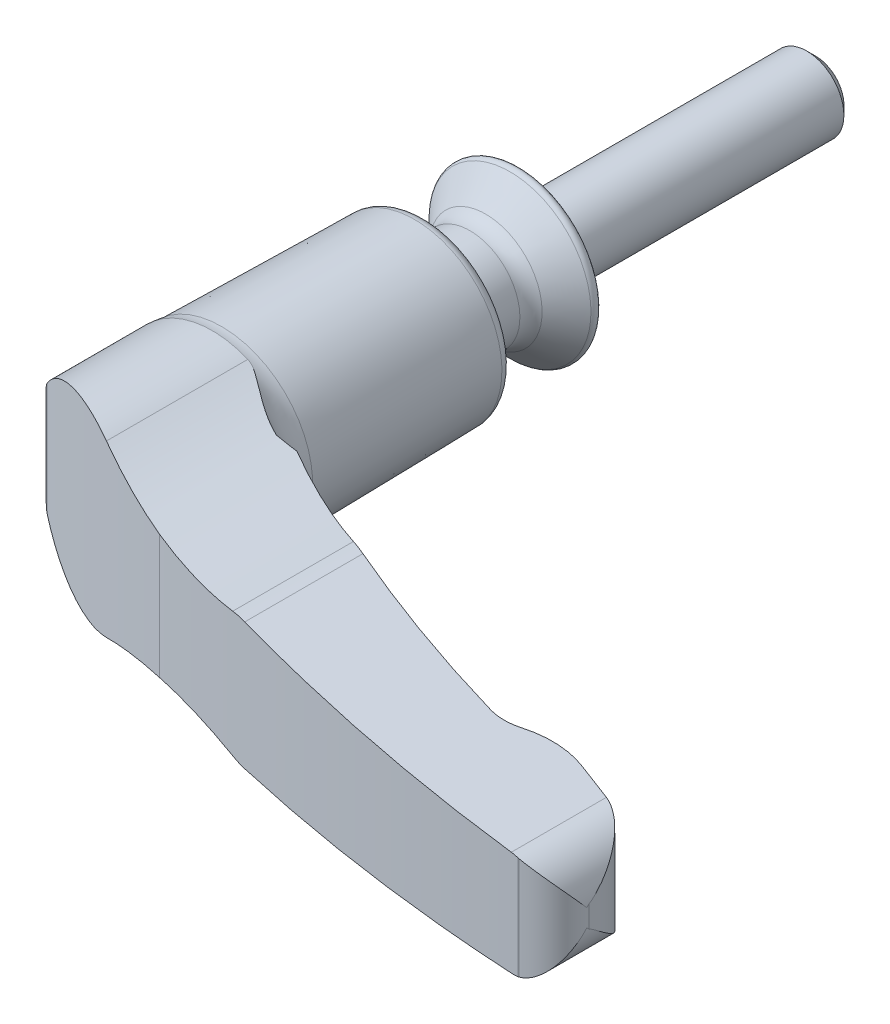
ISO-10303-21;
HEADER;
FILE_DESCRIPTION(('STEP AP214'),'2;1');
FILE_NAME('part.step','',(''),(''),'','','');
FILE_SCHEMA(('AUTOMOTIVE_DESIGN { 1 0 10303 214 1 1 1 1 }'));
ENDSEC;
DATA;
#1=APPLICATION_CONTEXT('core data for automotive mechanical design processes');
#2=APPLICATION_PROTOCOL_DEFINITION('international standard','automotive_design',2000,#1);
#3=PRODUCT_CONTEXT('',#1,'mechanical');
#4=PRODUCT('Part','Part','',(#3));
#5=PRODUCT_RELATED_PRODUCT_CATEGORY('part','',(#4));
#6=PRODUCT_DEFINITION_FORMATION('','',#4);
#7=PRODUCT_DEFINITION_CONTEXT('part definition',#1,'design');
#8=PRODUCT_DEFINITION('design','',#6,#7);
#9=PRODUCT_DEFINITION_SHAPE('','',#8);
#10=(LENGTH_UNIT() NAMED_UNIT(*) SI_UNIT(.MILLI.,.METRE.));
#11=(NAMED_UNIT(*) PLANE_ANGLE_UNIT() SI_UNIT($,.RADIAN.));
#12=(NAMED_UNIT(*) SI_UNIT($,.STERADIAN.) SOLID_ANGLE_UNIT());
#13=UNCERTAINTY_MEASURE_WITH_UNIT(LENGTH_MEASURE(1.E-05),#10,'distance_accuracy_value','');
#14=(GEOMETRIC_REPRESENTATION_CONTEXT(3) GLOBAL_UNCERTAINTY_ASSIGNED_CONTEXT((#13)) GLOBAL_UNIT_ASSIGNED_CONTEXT((#10,
#11,#12)) REPRESENTATION_CONTEXT('',''));
#15=CARTESIAN_POINT('',(0.,0.,0.));
#16=DIRECTION('',(0.,0.,1.));
#17=DIRECTION('',(1.,0.,0.));
#18=AXIS2_PLACEMENT_3D('',#15,#16,#17);
#19=CARTESIAN_POINT('',(-12.2494442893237,-13.45,40.2250875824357));
#20=DIRECTION('',(0.,0.,1.));
#21=DIRECTION('',(-1.,0.,0.));
#22=AXIS2_PLACEMENT_3D('',#19,#20,#21);
#23=PLANE('',#22);
#24=DIRECTION('',(0.,1.,0.));
#25=VECTOR('',#24,1.);
#26=CARTESIAN_POINT('',(-12.2494442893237,-13.45,40.2250875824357));
#27=LINE('',#26,#25);
#28=CARTESIAN_POINT('',(-12.2494442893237,-1.12726551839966,40.2250875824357));
#29=VERTEX_POINT('',#28);
#30=CARTESIAN_POINT('',(-12.2494442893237,0.,40.2250875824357));
#31=VERTEX_POINT('',#30);
#32=EDGE_CURVE('E175',#29,#31,#27,.T.);
#33=ORIENTED_EDGE('',*,*,#32,.T.);
#34=CARTESIAN_POINT('',(-1.62642046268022E-13,0.,40.2250875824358));
#35=DIRECTION('',(0.,0.,1.));
#36=DIRECTION('',(-1.,0.,0.));
#37=AXIS2_PLACEMENT_3D('',#34,#35,#36);
#38=CIRCLE('',#37,12.2494442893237);
#39=EDGE_CURVE('E178',#31,#31,#38,.F.);
#40=ORIENTED_EDGE('',*,*,#39,.F.);
#41=CARTESIAN_POINT('',(-12.2494442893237,1.12726551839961,40.2250875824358));
#42=VERTEX_POINT('',#41);
#43=EDGE_CURVE('E185',#31,#42,#27,.T.);
#44=ORIENTED_EDGE('',*,*,#43,.T.);
#45=CARTESIAN_POINT('',(0.,0.,40.2250875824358));
#46=DIRECTION('',(0.,0.,-1.));
#47=DIRECTION('',(1.,0.,0.));
#48=AXIS2_PLACEMENT_3D('',#45,#46,#47);
#49=CIRCLE('',#48,12.3012037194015);
#50=EDGE_CURVE('E180',#42,#29,#49,.T.);
#51=ORIENTED_EDGE('',*,*,#50,.T.);
#52=EDGE_LOOP('',(#33,#40,#44,#51));
#53=FACE_BOUND('',#52,.T.);
#54=ADVANCED_FACE('F14',(#53),#23,.F.);
#55=CARTESIAN_POINT('',(-12.3990914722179,-13.45,48.8947231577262));
#56=DIRECTION('',(0.999851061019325,0.,0.0172584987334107));
#57=DIRECTION('',(-0.0172584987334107,0.,0.999851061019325));
#58=AXIS2_PLACEMENT_3D('',#55,#56,#57);
#59=PLANE('',#58);
#60=ORIENTED_EDGE('',*,*,#43,.F.);
#61=ORIENTED_EDGE('',*,*,#32,.F.);
#62=CARTESIAN_POINT('',(-12.2494408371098,-1.12726105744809,40.2248875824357));
#63=CARTESIAN_POINT('',(-12.2501546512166,-1.12801102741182,40.2662415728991));
#64=CARTESIAN_POINT('',(-12.2508608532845,-1.13338949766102,40.3071545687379));
#65=CARTESIAN_POINT('',(-12.2522296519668,-1.15131266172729,40.3864543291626));
#66=CARTESIAN_POINT('',(-12.2528928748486,-1.16369170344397,40.4248773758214));
#67=CARTESIAN_POINT('',(-12.254538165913,-1.20206398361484,40.520195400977));
#68=CARTESIAN_POINT('',(-12.255493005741,-1.23180007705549,40.575512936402));
#69=CARTESIAN_POINT('',(-12.257344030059,-1.29909643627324,40.6827498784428));
#70=CARTESIAN_POINT('',(-12.2582382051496,-1.33683049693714,40.7345528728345));
#71=CARTESIAN_POINT('',(-12.2604895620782,-1.44052319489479,40.8649826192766));
#72=CARTESIAN_POINT('',(-12.2618006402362,-1.50977612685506,40.9409384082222));
#73=CARTESIAN_POINT('',(-12.264338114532,-1.65349391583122,41.0879440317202));
#74=CARTESIAN_POINT('',(-12.2655642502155,-1.72797350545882,41.1589787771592));
#75=CARTESIAN_POINT('',(-12.2678450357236,-1.87254522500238,41.2911134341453));
#76=CARTESIAN_POINT('',(-12.268904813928,-1.94236687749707,41.3525104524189));
#77=CARTESIAN_POINT('',(-12.2709847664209,-2.08326818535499,41.4730100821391));
#78=CARTESIAN_POINT('',(-12.2720051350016,-2.15433817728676,41.5321239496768));
#79=CARTESIAN_POINT('',(-12.2730148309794,-2.22587171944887,41.5906195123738));
#80=B_SPLINE_CURVE_WITH_KNOTS('',3,(#62,#63,#64,#65,#66,#67,#68,#69,#70,#71,#72,#73,#74,#75,#76,
#77,#78,#79),.UNSPECIFIED.,.F.,.F.,(4,2,2,2,2,2,2,2,4),(0.,0.123330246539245,0.243857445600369,
0.431247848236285,0.623227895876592,0.931023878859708,1.23972530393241,1.51862793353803,
1.79591047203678),.UNSPECIFIED.);
#81=CARTESIAN_POINT('',(-12.271249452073,-2.10212675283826,41.4883443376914));
#82=VERTEX_POINT('',#81);
#83=EDGE_CURVE('E399',#29,#82,#80,.T.);
#84=ORIENTED_EDGE('',*,*,#83,.T.);
#85=CARTESIAN_POINT('',(0.,0.,-669.432227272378));
#86=DIRECTION('',(0.999851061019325,0.,0.0172584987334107));
#87=DIRECTION('',(0.0172584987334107,0.,-0.999851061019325));
#88=AXIS2_PLACEMENT_3D('',#85,#86,#87);
#89=ELLIPSE('',#88,721.383718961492,12.45);
#90=CARTESIAN_POINT('',(-12.3990914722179,-1.12473581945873,48.8947231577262));
#91=VERTEX_POINT('',#90);
#92=EDGE_CURVE('E239',#82,#91,#89,.F.);
#93=ORIENTED_EDGE('',*,*,#92,.T.);
#94=DIRECTION('',(0.,1.,0.));
#95=VECTOR('',#94,1.);
#96=CARTESIAN_POINT('',(-12.3990914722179,-13.45,48.8947231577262));
#97=LINE('',#96,#95);
#98=CARTESIAN_POINT('',(-12.3990914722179,1.12473581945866,48.8947231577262));
#99=VERTEX_POINT('',#98);
#100=EDGE_CURVE('E184',#91,#99,#97,.T.);
#101=ORIENTED_EDGE('',*,*,#100,.T.);
#102=CARTESIAN_POINT('',(0.,0.,-669.432227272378));
#103=DIRECTION('',(0.999851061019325,0.,0.0172584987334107));
#104=DIRECTION('',(0.0172584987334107,0.,-0.999851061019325));
#105=AXIS2_PLACEMENT_3D('',#102,#103,#104);
#106=ELLIPSE('',#105,721.383718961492,12.45);
#107=CARTESIAN_POINT('',(-12.271249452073,2.10212675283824,41.4883443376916));
#108=VERTEX_POINT('',#107);
#109=EDGE_CURVE('E263',#99,#108,#106,.F.);
#110=ORIENTED_EDGE('',*,*,#109,.T.);
#111=CARTESIAN_POINT('',(-12.2730148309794,2.2258717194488,41.5906195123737));
#112=CARTESIAN_POINT('',(-12.2723484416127,2.17857656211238,41.5520130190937));
#113=CARTESIAN_POINT('',(-12.2716768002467,2.13153645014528,41.5131022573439));
#114=CARTESIAN_POINT('',(-12.2703199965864,2.03804940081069,41.4344974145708));
#115=CARTESIAN_POINT('',(-12.269634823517,1.99160298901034,41.3948027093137));
#116=CARTESIAN_POINT('',(-12.2675030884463,1.84986894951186,41.2713031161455));
#117=CARTESIAN_POINT('',(-12.2660309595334,1.75583214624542,41.1860170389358));
#118=CARTESIAN_POINT('',(-12.2637374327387,1.61936868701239,41.0531442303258));
#119=CARTESIAN_POINT('',(-12.2629577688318,1.574598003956,41.0079753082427));
#120=CARTESIAN_POINT('',(-12.2613598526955,1.48744881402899,40.9154018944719));
#121=CARTESIAN_POINT('',(-12.2605416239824,1.44506888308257,40.8679987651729));
#122=CARTESIAN_POINT('',(-12.2588634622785,1.36463549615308,40.7707764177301));
#123=CARTESIAN_POINT('',(-12.2580043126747,1.32652790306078,40.7210025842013));
#124=CARTESIAN_POINT('',(-12.2562147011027,1.25655247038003,40.6173235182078));
#125=CARTESIAN_POINT('',(-12.2552845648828,1.22465826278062,40.5634371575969));
#126=CARTESIAN_POINT('',(-12.2536883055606,1.18138793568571,40.4709597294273));
#127=CARTESIAN_POINT('',(-12.2530490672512,1.16676743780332,40.4339262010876));
#128=CARTESIAN_POINT('',(-12.2517389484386,1.14385333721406,40.3580259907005));
#129=CARTESIAN_POINT('',(-12.251068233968,1.13552979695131,40.3191689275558));
#130=CARTESIAN_POINT('',(-12.2500751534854,1.12891545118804,40.2616359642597));
#131=CARTESIAN_POINT('',(-12.2497582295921,1.12764004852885,40.2432753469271));
#132=CARTESIAN_POINT('',(-12.2494408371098,1.12726105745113,40.2248875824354));
#133=B_SPLINE_CURVE_WITH_KNOTS('',3,(#111,#112,#113,#114,#115,#116,#117,#118,#119,#120,#121,
#122,#123,#124,#125,#126,#127,#128,#129,#130,#131,#132),.UNSPECIFIED.,.F.,.F.,(4,2,2,2,2,2,2,2,
2,2,4),(0.,0.183152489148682,0.366457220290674,0.747103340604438,0.937859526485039,
1.12850085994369,1.31635856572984,1.50340080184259,1.62247471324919,1.74097889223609,
1.79613687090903),.UNSPECIFIED.);
#134=EDGE_CURVE('E190',#108,#42,#133,.T.);
#135=ORIENTED_EDGE('',*,*,#134,.T.);
#136=EDGE_LOOP('',(#60,#61,#84,#93,#101,#110,#135));
#137=FACE_BOUND('',#136,.T.);
#138=ADVANCED_FACE('F188',(#137),#59,.F.);
#139=CARTESIAN_POINT('',(111.767919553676,-13.45,-139.797819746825));
#140=DIRECTION('',(0.,1.,0.));
#141=DIRECTION('',(-1.,0.,0.));
#142=AXIS2_PLACEMENT_3D('',#139,#140,#141);
#143=CYLINDRICAL_SURFACE('',#142,208.999999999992);
#144=DIRECTION('',(0.,1.,0.));
#145=VECTOR('',#144,1.);
#146=CARTESIAN_POINT('',(15.7999999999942,-13.45,45.8662812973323));
#147=LINE('',#146,#145);
#148=CARTESIAN_POINT('',(15.8,-8.43613014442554,45.8662812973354));
#149=VERTEX_POINT('',#148);
#150=CARTESIAN_POINT('',(15.8,0.,45.8662812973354));
#151=VERTEX_POINT('',#150);
#152=EDGE_CURVE('E191',#149,#151,#147,.T.);
#153=ORIENTED_EDGE('',*,*,#152,.T.);
#154=DIRECTION('',(0.,1.,0.));
#155=VECTOR('',#154,1.);
#156=CARTESIAN_POINT('',(15.8,-13.45,45.8662812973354));
#157=LINE('',#156,#155);
#158=CARTESIAN_POINT('',(15.7999999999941,8.43613014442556,45.8662812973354));
#159=VERTEX_POINT('',#158);
#160=EDGE_CURVE('E413',#159,#151,#157,.F.);
#161=ORIENTED_EDGE('',*,*,#160,.F.);
#162=CARTESIAN_POINT('',(15.7999999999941,8.43613014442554,45.8662812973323));
#163=CARTESIAN_POINT('',(16.3870365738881,8.34717375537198,46.1697176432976));
#164=CARTESIAN_POINT('',(16.9767713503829,8.26904045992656,46.4710139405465));
#165=CARTESIAN_POINT('',(18.161091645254,8.13475115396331,47.0689822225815));
#166=CARTESIAN_POINT('',(18.7556773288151,8.07859589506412,47.3656540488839));
#167=CARTESIAN_POINT('',(20.5395968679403,7.94407204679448,48.2451118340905));
#168=CARTESIAN_POINT('',(21.7352391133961,7.89871013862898,48.8205177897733));
#169=CARTESIAN_POINT('',(24.1374209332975,7.89893976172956,49.9484747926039));
#170=CARTESIAN_POINT('',(25.3439611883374,7.94453701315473,50.5010244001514));
#171=CARTESIAN_POINT('',(27.1599173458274,8.0830634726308,51.3119106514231));
#172=CARTESIAN_POINT('',(27.7678474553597,8.14117035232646,51.5798888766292));
#173=CARTESIAN_POINT('',(28.9839481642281,8.28117670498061,52.1090693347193));
#174=CARTESIAN_POINT('',(29.5921187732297,8.36307725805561,52.370271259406));
#175=CARTESIAN_POINT('',(30.2000000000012,8.45699782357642,52.6279438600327));
#176=B_SPLINE_CURVE_WITH_KNOTS('',3,(#162,#163,#164,#165,#166,#167,#168,#169,#170,#171,#172,
#173,#174,#175),.UNSPECIFIED.,.F.,.F.,(4,2,2,2,2,2,4),(0.,2.00016069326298,4.00038978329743,
7.97994863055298,11.9597577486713,13.9600808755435,15.9604948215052),.UNSPECIFIED.);
#177=CARTESIAN_POINT('',(30.2000000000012,8.45699782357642,52.6279438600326));
#178=VERTEX_POINT('',#177);
#179=EDGE_CURVE('E264',#159,#178,#176,.T.);
#180=ORIENTED_EDGE('',*,*,#179,.T.);
#181=CARTESIAN_POINT('',(32.4002231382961,8.59297245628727,53.5458348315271));
#182=CARTESIAN_POINT('',(32.2157966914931,8.59945246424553,53.4701291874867));
#183=CARTESIAN_POINT('',(32.0313583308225,8.60144694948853,53.3941076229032));
#184=CARTESIAN_POINT('',(31.6631700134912,8.59650662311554,53.2417318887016));
#185=CARTESIAN_POINT('',(31.4794194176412,8.58958963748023,53.1653786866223));
#186=CARTESIAN_POINT('',(30.9288846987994,8.55552869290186,52.9356990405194));
#187=CARTESIAN_POINT('',(30.5630943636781,8.51506518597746,52.7818661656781));
#188=CARTESIAN_POINT('',(30.2000000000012,8.45699782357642,52.6279438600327));
#189=B_SPLINE_CURVE_WITH_KNOTS('',3,(#181,#182,#183,#184,#185,#186,#187,#188),.UNSPECIFIED.,.F.,
.F.,(4,2,2,4),(0.,0.598316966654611,1.19543895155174,2.3905773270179),.UNSPECIFIED.);
#190=CARTESIAN_POINT('',(32.4002231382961,8.59297245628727,53.5458348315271));
#191=VERTEX_POINT('',#190);
#192=EDGE_CURVE('E342',#191,#178,#189,.T.);
#193=ORIENTED_EDGE('',*,*,#192,.F.);
#194=CARTESIAN_POINT('',(111.767919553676,5.80486876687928,-139.797819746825));
#195=DIRECTION('',(-0.0351072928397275,-0.999383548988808,0.));
#196=DIRECTION('',(-0.999383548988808,0.0351072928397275,0.));
#197=AXIS2_PLACEMENT_3D('',#194,#195,#196);
#198=ELLIPSE('',#197,209.128917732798,208.999999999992);
#199=CARTESIAN_POINT('',(58.4999999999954,7.67611474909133,62.2999999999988));
#200=VERTEX_POINT('',#199);
#201=EDGE_CURVE('E350',#200,#191,#198,.T.);
#202=ORIENTED_EDGE('',*,*,#201,.F.);
#203=DIRECTION('',(0.,1.,0.));
#204=VECTOR('',#203,1.);
#205=CARTESIAN_POINT('',(58.4999999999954,-13.45,62.2999999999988));
#206=LINE('',#205,#204);
#207=CARTESIAN_POINT('',(58.4999999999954,-7.67611474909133,62.2999999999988));
#208=VERTEX_POINT('',#207);
#209=EDGE_CURVE('E193',#208,#200,#206,.T.);
#210=ORIENTED_EDGE('',*,*,#209,.F.);
#211=CARTESIAN_POINT('',(111.767919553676,-5.80486876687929,-139.797819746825));
#212=DIRECTION('',(-0.0351072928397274,0.999383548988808,0.));
#213=DIRECTION('',(0.999383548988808,0.0351072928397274,0.));
#214=AXIS2_PLACEMENT_3D('',#211,#212,#213);
#215=ELLIPSE('',#214,209.128917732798,208.999999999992);
#216=CARTESIAN_POINT('',(32.4002231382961,-8.59297245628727,53.5458348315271));
#217=VERTEX_POINT('',#216);
#218=EDGE_CURVE('E817',#217,#208,#215,.T.);
#219=ORIENTED_EDGE('',*,*,#218,.F.);
#220=CARTESIAN_POINT('',(30.2000000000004,-8.45699782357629,52.6279438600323));
#221=CARTESIAN_POINT('',(30.5630943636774,-8.51506518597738,52.7818661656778));
#222=CARTESIAN_POINT('',(30.9288846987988,-8.55552869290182,52.9356990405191));
#223=CARTESIAN_POINT('',(31.4794194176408,-8.58958963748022,53.1653786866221));
#224=CARTESIAN_POINT('',(31.6631700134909,-8.59650662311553,53.2417318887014));
#225=CARTESIAN_POINT('',(32.0313583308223,-8.60144694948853,53.3941076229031));
#226=CARTESIAN_POINT('',(32.215796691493,-8.59945246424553,53.4701291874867));
#227=CARTESIAN_POINT('',(32.4002231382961,-8.59297245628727,53.5458348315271));
#228=B_SPLINE_CURVE_WITH_KNOTS('',3,(#220,#221,#222,#223,#224,#225,#226,#227),.UNSPECIFIED.,.F.,
.F.,(4,2,2,4),(0.,1.19513837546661,1.79226036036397,2.39057732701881),.UNSPECIFIED.);
#229=CARTESIAN_POINT('',(30.2000000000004,-8.45699782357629,52.6279438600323));
#230=VERTEX_POINT('',#229);
#231=EDGE_CURVE('E317',#230,#217,#228,.T.);
#232=ORIENTED_EDGE('',*,*,#231,.F.);
#233=CARTESIAN_POINT('',(30.2,-8.45699782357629,52.6279438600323));
#234=CARTESIAN_POINT('',(29.5921187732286,-8.36307725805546,52.3702712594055));
#235=CARTESIAN_POINT('',(28.983948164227,-8.28117670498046,52.1090693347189));
#236=CARTESIAN_POINT('',(27.7678474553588,-8.14117035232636,51.5798888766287));
#237=CARTESIAN_POINT('',(27.1599173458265,-8.08306347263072,51.3119106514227));
#238=CARTESIAN_POINT('',(25.3439611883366,-7.94453701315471,50.5010244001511));
#239=CARTESIAN_POINT('',(24.1374209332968,-7.89893976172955,49.9484747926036));
#240=CARTESIAN_POINT('',(21.7352391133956,-7.89871013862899,48.820517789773));
#241=CARTESIAN_POINT('',(20.5395968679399,-7.9440720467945,48.2451118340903));
#242=CARTESIAN_POINT('',(18.7556773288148,-8.07859589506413,47.3656540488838));
#243=CARTESIAN_POINT('',(18.1610916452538,-8.13475115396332,47.0689822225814));
#244=CARTESIAN_POINT('',(16.9767713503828,-8.26904045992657,46.4710139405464));
#245=CARTESIAN_POINT('',(16.387036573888,-8.34717375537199,46.1697176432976));
#246=CARTESIAN_POINT('',(15.7999999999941,-8.43613014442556,45.8662812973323));
#247=B_SPLINE_CURVE_WITH_KNOTS('',3,(#233,#234,#235,#236,#237,#238,#239,#240,#241,#242,#243,
#244,#245,#246),.UNSPECIFIED.,.F.,.F.,(4,2,2,2,2,2,4),(0.,2.00041394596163,4.00073707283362,
7.98054619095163,11.9601050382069,13.9603341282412,15.960494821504),.UNSPECIFIED.);
#248=EDGE_CURVE('E335',#230,#149,#247,.T.);
#249=ORIENTED_EDGE('',*,*,#248,.T.);
#250=EDGE_LOOP('',(#153,#161,#180,#193,#202,#210,#219,#232,#249));
#251=FACE_BOUND('',#250,.T.);
#252=ADVANCED_FACE('F325',(#251),#143,.F.);
#253=CARTESIAN_POINT('',(76.9,-13.45,77.));
#254=DIRECTION('',(0.,0.,-1.));
#255=DIRECTION('',(0.,1.,0.));
#256=AXIS2_PLACEMENT_3D('',#253,#254,#255);
#257=PLANE('',#256);
#258=DIRECTION('',(0.,1.,0.));
#259=VECTOR('',#258,1.);
#260=CARTESIAN_POINT('',(76.9,-13.45,77.));
#261=LINE('',#260,#259);
#262=CARTESIAN_POINT('',(76.9,-6.92676825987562,77.));
#263=VERTEX_POINT('',#262);
#264=CARTESIAN_POINT('',(76.9,6.92676825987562,77.));
#265=VERTEX_POINT('',#264);
#266=EDGE_CURVE('E790',#263,#265,#261,.T.);
#267=ORIENTED_EDGE('',*,*,#266,.T.);
#268=CARTESIAN_POINT('',(75.6,1.17177043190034,77.));
#269=DIRECTION('',(0.,0.,-1.));
#270=DIRECTION('',(0.,1.,0.));
#271=AXIS2_PLACEMENT_3D('',#268,#269,#270);
#272=CIRCLE('',#271,5.9);
#273=CARTESIAN_POINT('',(76.8,6.94844767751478,77.));
#274=VERTEX_POINT('',#273);
#275=EDGE_CURVE('E860',#265,#274,#272,.F.);
#276=ORIENTED_EDGE('',*,*,#275,.T.);
#277=DIRECTION('',(0.,1.,0.));
#278=VECTOR('',#277,1.);
#279=CARTESIAN_POINT('',(76.8,-13.45,77.));
#280=LINE('',#279,#278);
#281=CARTESIAN_POINT('',(76.8,-6.94844767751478,77.));
#282=VERTEX_POINT('',#281);
#283=EDGE_CURVE('E788',#282,#274,#280,.T.);
#284=ORIENTED_EDGE('',*,*,#283,.F.);
#285=CARTESIAN_POINT('',(75.6,-1.17177043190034,77.));
#286=DIRECTION('',(0.,0.,-1.));
#287=DIRECTION('',(0.,1.,0.));
#288=AXIS2_PLACEMENT_3D('',#285,#286,#287);
#289=CIRCLE('',#288,5.9);
#290=EDGE_CURVE('E903',#282,#263,#289,.F.);
#291=ORIENTED_EDGE('',*,*,#290,.T.);
#292=EDGE_LOOP('',(#267,#276,#284,#291));
#293=FACE_BOUND('',#292,.T.);
#294=ADVANCED_FACE('F329',(#293),#257,.F.);
#295=CARTESIAN_POINT('',(99.3774025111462,-13.45,-191.753327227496));
#296=DIRECTION('',(0.,1.,0.));
#297=DIRECTION('',(-1.,0.,0.));
#298=AXIS2_PLACEMENT_3D('',#295,#296,#297);
#299=CYLINDRICAL_SURFACE('',#298,269.7);
#300=CARTESIAN_POINT('',(16.1999999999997,8.37725139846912,64.8));
#301=CARTESIAN_POINT('',(16.7767031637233,8.29486390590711,64.9869756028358));
#302=CARTESIAN_POINT('',(17.3553557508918,8.22300064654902,65.1724296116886));
#303=CARTESIAN_POINT('',(18.5159500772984,8.10050516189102,65.5400576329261));
#304=CARTESIAN_POINT('',(19.0978918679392,8.04987326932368,65.7222315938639));
#305=CARTESIAN_POINT('',(20.8414876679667,7.93052773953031,66.2615450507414));
#306=CARTESIAN_POINT('',(22.0070770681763,7.89348273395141,66.6134754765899));
#307=CARTESIAN_POINT('',(24.3425845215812,7.90540743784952,67.3013928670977));
#308=CARTESIAN_POINT('',(25.512502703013,7.95437971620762,67.6373793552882));
#309=CARTESIAN_POINT('',(27.2687809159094,8.09314767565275,68.1289718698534));
#310=CARTESIAN_POINT('',(27.8560018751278,8.15052863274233,68.2911856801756));
#311=CARTESIAN_POINT('',(29.0291528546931,8.28726693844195,68.611001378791));
#312=CARTESIAN_POINT('',(29.6150828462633,8.36662477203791,68.7686031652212));
#313=CARTESIAN_POINT('',(30.2000000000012,8.45699782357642,68.9238236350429));
#314=B_SPLINE_CURVE_WITH_KNOTS('',3,(#300,#301,#302,#303,#304,#305,#306,#307,#308,#309,#310,
#311,#312,#313),.UNSPECIFIED.,.F.,.F.,(4,2,2,2,2,2,4),(0.,1.83529834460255,3.6706254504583,
7.32170279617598,10.9728891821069,12.808257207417,14.6436657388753),.UNSPECIFIED.);
#315=CARTESIAN_POINT('',(16.1999999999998,8.37725139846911,64.8));
#316=VERTEX_POINT('',#315);
#317=CARTESIAN_POINT('',(30.2000000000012,8.45699782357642,68.9238236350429));
#318=VERTEX_POINT('',#317);
#319=EDGE_CURVE('E775',#316,#318,#314,.T.);
#320=ORIENTED_EDGE('',*,*,#319,.F.);
#321=DIRECTION('',(0.,1.,0.));
#322=VECTOR('',#321,1.);
#323=CARTESIAN_POINT('',(16.1999999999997,-13.45,64.8));
#324=LINE('',#323,#322);
#325=CARTESIAN_POINT('',(16.1999999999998,-8.37725139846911,64.8));
#326=VERTEX_POINT('',#325);
#327=EDGE_CURVE('E349',#326,#316,#324,.T.);
#328=ORIENTED_EDGE('',*,*,#327,.F.);
#329=CARTESIAN_POINT('',(30.2,-8.45699782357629,68.9238236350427));
#330=CARTESIAN_POINT('',(29.6150828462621,-8.36662477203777,68.7686031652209));
#331=CARTESIAN_POINT('',(29.029152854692,-8.28726693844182,68.6110013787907));
#332=CARTESIAN_POINT('',(27.8560018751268,-8.15052863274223,68.2911856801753));
#333=CARTESIAN_POINT('',(27.2687809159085,-8.09314767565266,68.1289718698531));
#334=CARTESIAN_POINT('',(25.5125027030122,-7.95437971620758,67.637379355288));
#335=CARTESIAN_POINT('',(24.3425845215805,-7.9054074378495,67.3013928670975));
#336=CARTESIAN_POINT('',(22.0070770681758,-7.89348273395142,66.6134754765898));
#337=CARTESIAN_POINT('',(20.8414876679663,-7.93052773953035,66.2615450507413));
#338=CARTESIAN_POINT('',(19.097891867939,-8.0498732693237,65.7222315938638));
#339=CARTESIAN_POINT('',(18.5159500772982,-8.10050516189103,65.540057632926));
#340=CARTESIAN_POINT('',(17.3553557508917,-8.22300064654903,65.1724296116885));
#341=CARTESIAN_POINT('',(16.7767031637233,-8.29486390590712,64.9869756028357));
#342=CARTESIAN_POINT('',(16.1999999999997,-8.37725139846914,64.8));
#343=B_SPLINE_CURVE_WITH_KNOTS('',3,(#329,#330,#331,#332,#333,#334,#335,#336,#337,#338,#339,
#340,#341,#342),.UNSPECIFIED.,.F.,.F.,(4,2,2,2,2,2,4),(0.,1.83540853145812,3.67077655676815,
7.32196294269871,10.9730402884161,12.8083673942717,14.6436657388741),.UNSPECIFIED.);
#344=CARTESIAN_POINT('',(30.2000000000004,-8.45699782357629,68.9238236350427));
#345=VERTEX_POINT('',#344);
#346=EDGE_CURVE('E446',#345,#326,#343,.T.);
#347=ORIENTED_EDGE('',*,*,#346,.F.);
#348=CARTESIAN_POINT('',(30.2000000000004,-8.45699782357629,68.9238236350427));
#349=CARTESIAN_POINT('',(30.5632894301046,-8.51510955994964,69.0202386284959));
#350=CARTESIAN_POINT('',(30.9292671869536,-8.55556829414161,69.1165394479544));
#351=CARTESIAN_POINT('',(31.4798508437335,-8.58960835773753,69.2601745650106));
#352=CARTESIAN_POINT('',(31.6635722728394,-8.5965163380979,69.3078974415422));
#353=CARTESIAN_POINT('',(32.0316308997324,-8.60144626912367,69.4030885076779));
#354=CARTESIAN_POINT('',(32.21596856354,-8.59944866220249,69.4505559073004));
#355=CARTESIAN_POINT('',(32.4002231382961,-8.59297245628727,69.4977922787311));
#356=B_SPLINE_CURVE_WITH_KNOTS('',3,(#348,#349,#350,#351,#352,#353,#354,#355),.UNSPECIFIED.,.F.,
.F.,(4,2,2,4),(0.,1.14021168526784,1.70984874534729,2.2807374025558),.UNSPECIFIED.);
#357=CARTESIAN_POINT('',(32.4002231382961,-8.59297245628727,69.497792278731));
#358=VERTEX_POINT('',#357);
#359=EDGE_CURVE('E292',#345,#358,#356,.T.);
#360=ORIENTED_EDGE('',*,*,#359,.T.);
#361=CARTESIAN_POINT('',(99.3774025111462,-6.24013459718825,-191.753327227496));
#362=DIRECTION('',(-0.0351072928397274,0.999383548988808,0.));
#363=DIRECTION('',(0.999383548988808,0.0351072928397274,0.));
#364=AXIS2_PLACEMENT_3D('',#361,#362,#363);
#365=ELLIPSE('',#364,269.866359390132,269.7);
#366=CARTESIAN_POINT('',(75.8071330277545,-7.06813337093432,76.9147438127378));
#367=VERTEX_POINT('',#366);
#368=EDGE_CURVE('E304',#358,#367,#365,.T.);
#369=ORIENTED_EDGE('',*,*,#368,.T.);
#370=CARTESIAN_POINT('',(75.8071330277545,-7.06813337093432,76.9147438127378));
#371=CARTESIAN_POINT('',(75.9742663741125,-7.06223993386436,76.929403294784));
#372=CARTESIAN_POINT('',(76.1405719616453,-7.04931940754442,76.943837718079));
#373=CARTESIAN_POINT('',(76.4715276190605,-7.00942417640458,76.9722564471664));
#374=CARTESIAN_POINT('',(76.6361776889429,-6.98244947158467,76.9862407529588));
#375=CARTESIAN_POINT('',(76.8,-6.94844767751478,77.));
#376=B_SPLINE_CURVE_WITH_KNOTS('',3,(#370,#371,#372,#373,#374,#375),.UNSPECIFIED.,.F.,.F.,(4,2,
4),(0.,0.50229032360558,1.00458064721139),.UNSPECIFIED.);
#377=EDGE_CURVE('E905',#367,#282,#376,.T.);
#378=ORIENTED_EDGE('',*,*,#377,.T.);
#379=ORIENTED_EDGE('',*,*,#283,.T.);
#380=CARTESIAN_POINT('',(76.8,6.94844767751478,77.));
#381=CARTESIAN_POINT('',(76.6361776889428,6.98244947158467,76.9862407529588));
#382=CARTESIAN_POINT('',(76.4715276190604,7.00942417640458,76.9722564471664));
#383=CARTESIAN_POINT('',(76.1405719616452,7.04931940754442,76.943837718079));
#384=CARTESIAN_POINT('',(75.9742663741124,7.06223993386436,76.929403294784));
#385=CARTESIAN_POINT('',(75.8071330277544,7.06813337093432,76.9147438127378));
#386=B_SPLINE_CURVE_WITH_KNOTS('',3,(#380,#381,#382,#383,#384,#385),.UNSPECIFIED.,.F.,.F.,(4,2,
4),(0.,0.502290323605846,1.00458064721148),.UNSPECIFIED.);
#387=CARTESIAN_POINT('',(75.8071330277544,7.06813337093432,76.9147438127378));
#388=VERTEX_POINT('',#387);
#389=EDGE_CURVE('E847',#274,#388,#386,.T.);
#390=ORIENTED_EDGE('',*,*,#389,.T.);
#391=CARTESIAN_POINT('',(99.3774025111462,6.24013459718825,-191.753327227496));
#392=DIRECTION('',(-0.0351072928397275,-0.999383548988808,0.));
#393=DIRECTION('',(-0.999383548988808,0.0351072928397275,0.));
#394=AXIS2_PLACEMENT_3D('',#391,#392,#393);
#395=ELLIPSE('',#394,269.866359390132,269.7);
#396=CARTESIAN_POINT('',(32.4002231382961,8.59297245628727,69.497792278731));
#397=VERTEX_POINT('',#396);
#398=EDGE_CURVE('E372',#388,#397,#395,.T.);
#399=ORIENTED_EDGE('',*,*,#398,.T.);
#400=CARTESIAN_POINT('',(32.4002231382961,8.59297245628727,69.497792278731));
#401=CARTESIAN_POINT('',(32.2159685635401,8.59944866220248,69.4505559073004));
#402=CARTESIAN_POINT('',(32.0316308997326,8.60144626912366,69.4030885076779));
#403=CARTESIAN_POINT('',(31.6635722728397,8.5965163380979,69.3078974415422));
#404=CARTESIAN_POINT('',(31.4798508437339,8.58960835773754,69.2601745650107));
#405=CARTESIAN_POINT('',(30.9292671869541,8.55556829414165,69.1165394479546));
#406=CARTESIAN_POINT('',(30.5632894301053,8.51510955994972,69.0202386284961));
#407=CARTESIAN_POINT('',(30.2000000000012,8.45699782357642,68.9238236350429));
#408=B_SPLINE_CURVE_WITH_KNOTS('',3,(#400,#401,#402,#403,#404,#405,#406,#407),.UNSPECIFIED.,.F.,
.F.,(4,2,2,4),(0.,0.5708886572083,1.14052571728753,2.28073740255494),.UNSPECIFIED.);
#409=EDGE_CURVE('E363',#397,#318,#408,.T.);
#410=ORIENTED_EDGE('',*,*,#409,.T.);
#411=EDGE_LOOP('',(#320,#328,#347,#360,#369,#378,#379,#390,#399,#410));
#412=FACE_BOUND('',#411,.T.);
#413=ADVANCED_FACE('F306',(#412),#299,.T.);
#414=CARTESIAN_POINT('',(79.8840849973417,-13.45,-124.78991881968));
#415=DIRECTION('',(0.,1.,0.));
#416=DIRECTION('',(-1.,0.,0.));
#417=AXIS2_PLACEMENT_3D('',#414,#415,#416);
#418=CYLINDRICAL_SURFACE('',#417,200.000000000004);
#419=DIRECTION('',(0.,1.,0.));
#420=VECTOR('',#419,1.);
#421=CARTESIAN_POINT('',(-9.90000000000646,-13.45,53.9244289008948));
#422=LINE('',#421,#420);
#423=CARTESIAN_POINT('',(-9.90000000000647,-7.54933771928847,53.9244289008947));
#424=VERTEX_POINT('',#423);
#425=CARTESIAN_POINT('',(-9.90000000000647,7.54933771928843,53.9244289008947));
#426=VERTEX_POINT('',#425);
#427=EDGE_CURVE('E199',#424,#426,#422,.T.);
#428=ORIENTED_EDGE('',*,*,#427,.F.);
#429=CARTESIAN_POINT('',(-9.90000000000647,-7.54933771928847,53.9244289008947));
#430=CARTESIAN_POINT('',(-9.67451817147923,-7.84507120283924,54.0377127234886));
#431=CARTESIAN_POINT('',(-9.4368447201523,-8.12923310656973,54.1565790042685));
#432=CARTESIAN_POINT('',(-8.93966759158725,-8.67296304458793,54.403880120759));
#433=CARTESIAN_POINT('',(-8.68017587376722,-8.93254438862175,54.5323097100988));
#434=CARTESIAN_POINT('',(-8.14219185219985,-9.42550410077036,54.7970082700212));
#435=CARTESIAN_POINT('',(-7.86373776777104,-9.65893280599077,54.9332613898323));
#436=CARTESIAN_POINT('',(-7.28965149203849,-10.0992248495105,55.2124187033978));
#437=CARTESIAN_POINT('',(-6.994017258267,-10.3060850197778,55.3553236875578));
#438=CARTESIAN_POINT('',(-6.38843577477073,-10.6920089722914,55.6461218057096));
#439=CARTESIAN_POINT('',(-6.07851806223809,-10.8711270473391,55.7940044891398));
#440=CARTESIAN_POINT('',(-5.44596700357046,-11.2013953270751,56.0937585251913));
#441=CARTESIAN_POINT('',(-5.12333306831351,-11.3525442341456,56.2456300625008));
#442=CARTESIAN_POINT('',(-4.46756903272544,-11.6262415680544,56.5521043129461));
#443=CARTESIAN_POINT('',(-4.13444284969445,-11.7488005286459,56.7067059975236));
#444=CARTESIAN_POINT('',(-3.45976822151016,-11.9648655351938,57.0175072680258));
#445=CARTESIAN_POINT('',(-3.11822142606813,-12.0583772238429,57.1737065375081));
#446=CARTESIAN_POINT('',(-2.31903314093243,-12.2409805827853,57.5364253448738));
#447=CARTESIAN_POINT('',(-1.85895294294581,-12.3192478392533,57.743179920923));
#448=CARTESIAN_POINT('',(-1.16440659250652,-12.3976193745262,58.0521070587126));
#449=CARTESIAN_POINT('',(-0.932215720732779,-12.4172382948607,58.1548548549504));
#450=CARTESIAN_POINT('',(-0.466758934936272,-12.443430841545,58.3597645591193));
#451=CARTESIAN_POINT('',(-0.233492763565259,-12.4500011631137,58.4619263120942));
#452=CARTESIAN_POINT('',(0.405450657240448,-12.4499979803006,58.7403022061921));
#453=CARTESIAN_POINT('',(0.811584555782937,-12.4301810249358,58.9156432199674));
#454=CARTESIAN_POINT('',(1.62179032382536,-12.3506318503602,59.2622685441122));
#455=CARTESIAN_POINT('',(2.02586144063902,-12.2908859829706,59.4335514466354));
#456=CARTESIAN_POINT('',(2.83079805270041,-12.1308842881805,59.7716755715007));
#457=CARTESIAN_POINT('',(3.23162970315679,-12.030387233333,59.9384839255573));
#458=CARTESIAN_POINT('',(4.02384464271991,-11.7891025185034,60.2652335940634));
#459=CARTESIAN_POINT('',(4.41522782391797,-11.6483143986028,60.4251748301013));
#460=CARTESIAN_POINT('',(4.79999999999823,-11.4874931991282,60.5810071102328));
#461=B_SPLINE_CURVE_WITH_KNOTS('',3,(#429,#430,#431,#432,#433,#434,#435,#436,#437,#438,#439,
#440,#441,#442,#443,#444,#445,#446,#447,#448,#449,#450,#451,#452,#453,#454,#455,#456,#457,#458,
#459,#460),.UNSPECIFIED.,.F.,.F.,(4,2,2,2,2,2,2,2,2,2,2,2,2,2,2,4),(0.,1.16572536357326,
2.33081586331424,3.49362387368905,4.65657040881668,5.81721142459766,6.97790627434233,
8.1381727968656,9.29821378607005,10.8264676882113,11.5901890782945,12.3541038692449,
13.6806107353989,15.007571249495,16.3425041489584,17.67745228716),.UNSPECIFIED.);
#462=CARTESIAN_POINT('',(4.79999999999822,-11.4874931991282,60.5810071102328));
#463=VERTEX_POINT('',#462);
#464=EDGE_CURVE('E202',#424,#463,#461,.T.);
#465=ORIENTED_EDGE('',*,*,#464,.T.);
#466=CARTESIAN_POINT('',(16.1999999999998,-8.37725139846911,64.8));
#467=CARTESIAN_POINT('',(15.21368787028,-8.51813618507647,64.4687294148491));
#468=CARTESIAN_POINT('',(14.2339762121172,-8.68971619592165,64.1310391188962));
#469=CARTESIAN_POINT('',(12.2943158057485,-9.09213654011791,63.4457683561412));
#470=CARTESIAN_POINT('',(11.3343097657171,-9.32276678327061,63.0982267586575));
#471=CARTESIAN_POINT('',(9.43367460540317,-9.8421618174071,62.3938598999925));
#472=CARTESIAN_POINT('',(8.49304509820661,-10.1309254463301,62.0370348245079));
#473=CARTESIAN_POINT('',(6.63069309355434,-10.7662294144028,61.3147410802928));
#474=CARTESIAN_POINT('',(5.70904885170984,-11.1129696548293,60.9492463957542));
#475=CARTESIAN_POINT('',(4.79999999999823,-11.4874931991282,60.5810071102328));
#476=B_SPLINE_CURVE_WITH_KNOTS('',3,(#466,#467,#468,#469,#470,#471,#472,#473,#474,#475),
.UNSPECIFIED.,.F.,.F.,(4,2,2,2,4),(0.,3.14928931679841,6.2875260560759,9.42570006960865,
12.5749263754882),.UNSPECIFIED.);
#477=EDGE_CURVE('E211',#326,#463,#476,.T.);
#478=ORIENTED_EDGE('',*,*,#477,.F.);
#479=ORIENTED_EDGE('',*,*,#327,.T.);
#480=CARTESIAN_POINT('',(4.7999999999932,11.4874931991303,60.5810071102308));
#481=CARTESIAN_POINT('',(5.70904885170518,11.1129696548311,60.9492463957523));
#482=CARTESIAN_POINT('',(6.63069309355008,10.7662294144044,61.3147410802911));
#483=CARTESIAN_POINT('',(8.49304509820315,10.1309254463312,62.0370348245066));
#484=CARTESIAN_POINT('',(9.43367460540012,9.84216181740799,62.3938598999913));
#485=CARTESIAN_POINT('',(11.3343097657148,9.32276678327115,63.0982267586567));
#486=CARTESIAN_POINT('',(12.2943158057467,9.0921365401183,63.4457683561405));
#487=CARTESIAN_POINT('',(14.2339762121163,8.6897161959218,64.1310391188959));
#488=CARTESIAN_POINT('',(15.2136878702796,8.51813618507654,64.4687294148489));
#489=CARTESIAN_POINT('',(16.1999999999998,8.37725139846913,64.8));
#490=B_SPLINE_CURVE_WITH_KNOTS('',3,(#480,#481,#482,#483,#484,#485,#486,#487,#488,#489),
.UNSPECIFIED.,.F.,.F.,(4,2,2,2,4),(0.,3.14922630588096,6.28740031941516,9.42563705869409,
12.574926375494),.UNSPECIFIED.);
#491=CARTESIAN_POINT('',(4.7999999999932,11.4874931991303,60.5810071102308));
#492=VERTEX_POINT('',#491);
#493=EDGE_CURVE('E293',#492,#316,#490,.T.);
#494=ORIENTED_EDGE('',*,*,#493,.F.);
#495=CARTESIAN_POINT('',(4.79999999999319,11.4874931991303,60.5810071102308));
#496=CARTESIAN_POINT('',(4.41580947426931,11.6480694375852,60.425410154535));
#497=CARTESIAN_POINT('',(4.02503382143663,11.7886738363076,60.2657194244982));
#498=CARTESIAN_POINT('',(3.23419246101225,12.0296727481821,59.9395455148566));
#499=CARTESIAN_POINT('',(2.8341300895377,12.1300814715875,59.7730647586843));
#500=CARTESIAN_POINT('',(2.02936760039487,12.2903278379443,59.4350346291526));
#501=CARTESIAN_POINT('',(1.62468227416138,12.3502704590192,59.2634995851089));
#502=CARTESIAN_POINT('',(0.8131282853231,12.4301064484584,58.9163098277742));
#503=CARTESIAN_POINT('',(0.406259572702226,12.4499988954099,58.7406550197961));
#504=CARTESIAN_POINT('',(-0.381370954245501,12.4500010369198,58.3974981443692));
#505=CARTESIAN_POINT('',(-0.762205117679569,12.432473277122,58.230155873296));
#506=CARTESIAN_POINT('',(-1.52013839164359,12.3627058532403,57.8943010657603));
#507=CARTESIAN_POINT('',(-1.89723770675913,12.310468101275,57.7257885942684));
#508=CARTESIAN_POINT('',(-2.64540716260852,12.1716555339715,57.3887062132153));
#509=CARTESIAN_POINT('',(-3.0164722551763,12.0850533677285,57.2201363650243));
#510=CARTESIAN_POINT('',(-3.74968971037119,11.8780234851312,56.884389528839));
#511=CARTESIAN_POINT('',(-4.11184217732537,11.7575961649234,56.717212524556));
#512=CARTESIAN_POINT('',(-4.82530709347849,11.4832593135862,56.3853387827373));
#513=CARTESIAN_POINT('',(-5.17659902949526,11.329290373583,56.2206470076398));
#514=CARTESIAN_POINT('',(-5.86509267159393,10.9886630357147,55.8955080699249));
#515=CARTESIAN_POINT('',(-6.20229273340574,10.8020008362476,55.7350614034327));
#516=CARTESIAN_POINT('',(-6.85929279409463,10.3971732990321,55.4202886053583));
#517=CARTESIAN_POINT('',(-7.17912282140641,10.1790648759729,55.2659520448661));
#518=CARTESIAN_POINT('',(-7.79913838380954,9.71218172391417,54.9648338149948));
#519=CARTESIAN_POINT('',(-8.09933309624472,9.46342148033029,54.8180486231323));
#520=CARTESIAN_POINT('',(-8.6621015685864,8.9502892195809,54.5412436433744));
#521=CARTESIAN_POINT('',(-8.92582503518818,8.6874365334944,54.410747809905));
#522=CARTESIAN_POINT('',(-9.43052390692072,8.13678568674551,54.1597401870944));
#523=CARTESIAN_POINT('',(-9.67151657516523,7.8490067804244,54.03922082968));
#524=CARTESIAN_POINT('',(-9.90000000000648,7.54933771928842,53.9244289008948));
#525=B_SPLINE_CURVE_WITH_KNOTS('',3,(#495,#496,#497,#498,#499,#500,#501,#502,#503,#504,#505,
#506,#507,#508,#509,#510,#511,#512,#513,#514,#515,#516,#517,#518,#519,#520,#521,#522,#523,#524),
.UNSPECIFIED.,.F.,.F.,(4,2,2,2,2,2,2,2,2,2,2,2,2,2,4),(0.,1.33291829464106,2.66536494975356,
3.99434151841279,5.32334866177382,6.5709370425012,7.81845670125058,9.06697126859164,
10.3154712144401,11.5662007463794,12.8170758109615,14.0657146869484,15.3137657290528,
16.4958742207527,17.6770775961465),.UNSPECIFIED.);
#526=EDGE_CURVE('E286',#492,#426,#525,.T.);
#527=ORIENTED_EDGE('',*,*,#526,.T.);
#528=EDGE_LOOP('',(#428,#465,#478,#479,#494,#527));
#529=FACE_BOUND('',#528,.T.);
#530=ADVANCED_FACE('F248',(#529),#418,.T.);
#531=CARTESIAN_POINT('',(-6.3,-13.45,49.0000000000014));
#532=DIRECTION('',(0.,1.,0.));
#533=DIRECTION('',(-1.,0.,0.));
#534=AXIS2_PLACEMENT_3D('',#531,#532,#533);
#535=CYLINDRICAL_SURFACE('',#534,6.1);
#536=ORIENTED_EDGE('',*,*,#427,.T.);
#537=CARTESIAN_POINT('',(-9.90000000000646,7.54933771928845,53.9244289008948));
#538=CARTESIAN_POINT('',(-10.0046272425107,7.41212768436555,53.8479316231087));
#539=CARTESIAN_POINT('',(-10.1057058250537,7.27366477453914,53.7689319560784));
#540=CARTESIAN_POINT('',(-10.3008751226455,6.99453251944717,53.6064237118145));
#541=CARTESIAN_POINT('',(-10.3949674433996,6.8538636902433,53.5229161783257));
#542=CARTESIAN_POINT('',(-10.6668294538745,6.42916605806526,53.2664803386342));
#543=CARTESIAN_POINT('',(-10.8343792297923,6.14218866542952,53.0874940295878));
#544=CARTESIAN_POINT('',(-11.1421944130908,5.56422896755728,52.7176240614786));
#545=CARTESIAN_POINT('',(-11.2826072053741,5.27327804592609,52.5268125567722));
#546=CARTESIAN_POINT('',(-11.5382549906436,4.68755769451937,52.1345668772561));
#547=CARTESIAN_POINT('',(-11.6534929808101,4.39278872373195,51.9331339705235));
#548=CARTESIAN_POINT('',(-11.822924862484,3.90661945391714,51.5940966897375));
#549=CARTESIAN_POINT('',(-11.8842552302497,3.71572911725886,51.4592618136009));
#550=CARTESIAN_POINT('',(-11.9969703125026,3.33388552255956,51.1855148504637));
#551=CARTESIAN_POINT('',(-12.0483542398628,3.14293226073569,51.0466024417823));
#552=CARTESIAN_POINT('',(-12.1260618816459,2.82462255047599,50.8102464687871));
#553=CARTESIAN_POINT('',(-12.1550800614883,2.6969298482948,50.7141297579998));
#554=CARTESIAN_POINT('',(-12.2086854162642,2.44281059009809,50.5191072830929));
#555=CARTESIAN_POINT('',(-12.2332743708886,2.31638354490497,50.420202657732));
#556=CARTESIAN_POINT('',(-12.2704776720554,2.10831497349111,50.2522334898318));
#557=CARTESIAN_POINT('',(-12.2843345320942,2.02594231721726,50.1843484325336));
#558=CARTESIAN_POINT('',(-12.3100752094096,1.86314619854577,50.0459284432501));
#559=CARTESIAN_POINT('',(-12.3219596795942,1.78272209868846,49.9753943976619));
#560=CARTESIAN_POINT('',(-12.3424058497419,1.63475623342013,49.8387611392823));
#561=CARTESIAN_POINT('',(-12.3511943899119,1.56681696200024,49.7731262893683));
#562=CARTESIAN_POINT('',(-12.3670759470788,1.43603364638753,49.6366694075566));
#563=CARTESIAN_POINT('',(-12.3741715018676,1.37318207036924,49.5658553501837));
#564=CARTESIAN_POINT('',(-12.3830656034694,1.28954286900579,49.4555496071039));
#565=CARTESIAN_POINT('',(-12.3856658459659,1.26425474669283,49.4195939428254));
#566=CARTESIAN_POINT('',(-12.3903418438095,1.21756776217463,49.3451522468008));
#567=CARTESIAN_POINT('',(-12.3924179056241,1.19616662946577,49.3066677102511));
#568=CARTESIAN_POINT('',(-12.3955976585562,1.16270888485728,49.2340076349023));
#569=CARTESIAN_POINT('',(-12.3968091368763,1.14966347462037,49.2003044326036));
#570=CARTESIAN_POINT('',(-12.3986849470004,1.12925581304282,49.1312436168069));
#571=CARTESIAN_POINT('',(-12.3993512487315,1.12187310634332,49.0958924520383));
#572=CARTESIAN_POINT('',(-12.3999734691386,1.11497561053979,49.0327446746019));
#573=CARTESIAN_POINT('',(-12.4000585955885,1.11402993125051,49.0051039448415));
#574=CARTESIAN_POINT('',(-12.3998578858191,1.11624858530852,48.9497493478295));
#575=CARTESIAN_POINT('',(-12.399568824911,1.11944864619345,48.9220369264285));
#576=CARTESIAN_POINT('',(-12.3990914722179,1.12473581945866,48.8947231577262));
#577=B_SPLINE_CURVE_WITH_KNOTS('',3,(#537,#538,#539,#540,#541,#542,#543,#544,#545,#546,#547,
#548,#549,#550,#551,#552,#553,#554,#555,#556,#557,#558,#559,#560,#561,#562,#563,#564,#565,#566,
#567,#568,#569,#570,#571,#572,#573,#574,#575,#576),.UNSPECIFIED.,.F.,.F.,(4,2,2,2,2,2,2,2,2,2,2,
2,2,2,2,2,2,2,2,4),(0.,0.566113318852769,1.13209611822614,2.26300366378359,3.38758494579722,
4.5120322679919,5.23669041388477,5.96140588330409,6.44865012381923,6.93569814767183,
7.25857007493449,7.58133490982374,7.86586699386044,8.14996984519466,8.28191970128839,
8.41379223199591,8.52191310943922,8.6296415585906,8.71230660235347,8.79568880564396),.UNSPECIFIED.);
#578=EDGE_CURVE('E254',#426,#99,#577,.T.);
#579=ORIENTED_EDGE('',*,*,#578,.T.);
#580=ORIENTED_EDGE('',*,*,#100,.F.);
#581=CARTESIAN_POINT('',(-12.3990914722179,-1.12473581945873,48.8947231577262));
#582=CARTESIAN_POINT('',(-12.3996477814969,-1.11855680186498,48.9263072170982));
#583=CARTESIAN_POINT('',(-12.3999461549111,-1.11526130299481,48.9584257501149));
#584=CARTESIAN_POINT('',(-12.4000388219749,-1.1142553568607,49.0224040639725));
#585=CARTESIAN_POINT('',(-12.3998385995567,-1.11648414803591,49.0542628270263));
#586=CARTESIAN_POINT('',(-12.398957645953,-1.12621618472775,49.1171143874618));
#587=CARTESIAN_POINT('',(-12.3982771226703,-1.13371714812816,49.1481075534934));
#588=CARTESIAN_POINT('',(-12.3965024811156,-1.152962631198,49.2087543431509));
#589=CARTESIAN_POINT('',(-12.3954074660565,-1.16471634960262,49.2384049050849));
#590=CARTESIAN_POINT('',(-12.3915693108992,-1.2050829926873,49.325952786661));
#591=CARTESIAN_POINT('',(-12.388289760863,-1.23859794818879,49.3815173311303));
#592=CARTESIAN_POINT('',(-12.3806880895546,-1.31242861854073,49.4879527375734));
#593=CARTESIAN_POINT('',(-12.376359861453,-1.35278373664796,49.5387936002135));
#594=CARTESIAN_POINT('',(-12.3663253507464,-1.44177329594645,49.6424016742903));
#595=CARTESIAN_POINT('',(-12.3605210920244,-1.49083153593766,49.6947913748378));
#596=CARTESIAN_POINT('',(-12.3479489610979,-1.59162003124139,49.7968362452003));
#597=CARTESIAN_POINT('',(-12.3411802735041,-1.64335252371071,49.8464890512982));
#598=CARTESIAN_POINT('',(-12.3194716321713,-1.80121349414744,49.9928499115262));
#599=CARTESIAN_POINT('',(-12.3031544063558,-1.90977427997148,50.0867143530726));
#600=CARTESIAN_POINT('',(-12.2669257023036,-2.13017179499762,50.2706532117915));
#601=CARTESIAN_POINT('',(-12.2469994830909,-2.24202032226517,50.3607101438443));
#602=CARTESIAN_POINT('',(-12.2036548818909,-2.46706676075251,50.5379086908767));
#603=CARTESIAN_POINT('',(-12.1802416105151,-2.58026247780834,50.6250543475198));
#604=CARTESIAN_POINT('',(-12.1164026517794,-2.86831170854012,50.843495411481));
#605=CARTESIAN_POINT('',(-12.0735859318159,-3.04368513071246,50.9734118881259));
#606=CARTESIAN_POINT('',(-11.9795791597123,-3.39488995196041,51.2295643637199));
#607=CARTESIAN_POINT('',(-11.9283877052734,-3.57072142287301,51.3557997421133));
#608=CARTESIAN_POINT('',(-11.7619352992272,-4.09821672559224,51.7298192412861));
#609=CARTESIAN_POINT('',(-11.6338805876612,-4.44949493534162,51.9726289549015));
#610=CARTESIAN_POINT('',(-11.34324189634,-5.14539140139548,52.4426131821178));
#611=CARTESIAN_POINT('',(-11.18082918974,-5.49003376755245,52.6698581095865));
#612=CARTESIAN_POINT('',(-10.8197440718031,-6.17121731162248,53.1063377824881));
#613=CARTESIAN_POINT('',(-10.6211196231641,-6.50776854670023,53.3155958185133));
#614=CARTESIAN_POINT('',(-10.3247304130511,-6.95867015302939,53.5850738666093));
#615=CARTESIAN_POINT('',(-10.2433360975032,-7.07796998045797,53.6553033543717));
#616=CARTESIAN_POINT('',(-10.075485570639,-7.31492708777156,53.7924366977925));
#617=CARTESIAN_POINT('',(-9.98902887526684,-7.43258420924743,53.8593402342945));
#618=CARTESIAN_POINT('',(-9.90000000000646,-7.54933771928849,53.9244289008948));
#619=B_SPLINE_CURVE_WITH_KNOTS('',3,(#581,#582,#583,#584,#585,#586,#587,#588,#589,#590,#591,
#592,#593,#594,#595,#596,#597,#598,#599,#600,#601,#602,#603,#604,#605,#606,#607,#608,#609,#610,
#611,#612,#613,#614,#615,#616,#617,#618),.UNSPECIFIED.,.F.,.F.,(4,2,2,2,2,2,2,2,2,2,2,2,2,2,2,2,
2,2,4),(0.,0.0963901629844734,0.191724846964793,0.287018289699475,0.382519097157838,
0.576300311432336,0.771238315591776,0.98706846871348,1.20308219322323,1.63612237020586,
2.07097291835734,2.50519231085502,3.17221143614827,3.83934236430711,5.17506750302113,
6.50428472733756,7.83175401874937,8.31342982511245,8.79515176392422),.UNSPECIFIED.);
#620=EDGE_CURVE('E230',#91,#424,#619,.T.);
#621=ORIENTED_EDGE('',*,*,#620,.T.);
#622=EDGE_LOOP('',(#536,#579,#580,#621));
#623=FACE_BOUND('',#622,.T.);
#624=ADVANCED_FACE('F243',(#623),#535,.T.);
#625=CARTESIAN_POINT('',(60.181295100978,-13.45,55.4019389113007));
#626=DIRECTION('',(0.,1.,0.));
#627=DIRECTION('',(-1.,0.,0.));
#628=AXIS2_PLACEMENT_3D('',#625,#626,#627);
#629=CYLINDRICAL_SURFACE('',#628,7.0999999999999);
#630=CARTESIAN_POINT('',(60.181295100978,7.61705262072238,55.4019389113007));
#631=DIRECTION('',(-0.0351072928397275,-0.999383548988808,0.));
#632=DIRECTION('',(-0.999383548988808,0.0351072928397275,0.));
#633=AXIS2_PLACEMENT_3D('',#630,#631,#632);
#634=ELLIPSE('',#633,7.10437950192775,7.0999999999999);
#635=CARTESIAN_POINT('',(62.4000000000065,7.53911185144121,62.1463698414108));
#636=VERTEX_POINT('',#635);
#637=EDGE_CURVE('E813',#636,#200,#634,.T.);
#638=ORIENTED_EDGE('',*,*,#637,.F.);
#639=DIRECTION('',(0.,1.,0.));
#640=VECTOR('',#639,1.);
#641=CARTESIAN_POINT('',(62.4000000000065,-13.45,62.1463698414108));
#642=LINE('',#641,#640);
#643=CARTESIAN_POINT('',(62.4000000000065,-7.53911185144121,62.1463698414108));
#644=VERTEX_POINT('',#643);
#645=EDGE_CURVE('E806',#644,#636,#642,.T.);
#646=ORIENTED_EDGE('',*,*,#645,.F.);
#647=CARTESIAN_POINT('',(60.181295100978,-7.61705262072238,55.4019389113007));
#648=DIRECTION('',(-0.0351072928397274,0.999383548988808,0.));
#649=DIRECTION('',(0.999383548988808,0.0351072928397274,0.));
#650=AXIS2_PLACEMENT_3D('',#647,#648,#649);
#651=ELLIPSE('',#650,7.10437950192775,7.0999999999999);
#652=EDGE_CURVE('E814',#208,#644,#651,.T.);
#653=ORIENTED_EDGE('',*,*,#652,.F.);
#654=ORIENTED_EDGE('',*,*,#209,.T.);
#655=EDGE_LOOP('',(#638,#646,#653,#654));
#656=FACE_BOUND('',#655,.T.);
#657=ADVANCED_FACE('F247',(#656),#629,.F.);
#658=CARTESIAN_POINT('',(66.4,-13.45,74.2));
#659=DIRECTION('',(0.,1.,0.));
#660=DIRECTION('',(-1.,0.,0.));
#661=AXIS2_PLACEMENT_3D('',#658,#659,#660);
#662=CYLINDRICAL_SURFACE('',#661,12.7);
#663=ORIENTED_EDGE('',*,*,#645,.T.);
#664=CARTESIAN_POINT('',(66.4,7.39859605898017,74.2));
#665=DIRECTION('',(-0.0351072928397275,-0.999383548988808,0.));
#666=DIRECTION('',(-0.999383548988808,0.0351072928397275,0.));
#667=AXIS2_PLACEMENT_3D('',#664,#665,#666);
#668=ELLIPSE('',#667,12.7078337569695,12.7);
#669=CARTESIAN_POINT('',(70.7,7.24754158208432,62.2501046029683));
#670=VERTEX_POINT('',#669);
#671=EDGE_CURVE('E819',#636,#670,#668,.T.);
#672=ORIENTED_EDGE('',*,*,#671,.T.);
#673=DIRECTION('',(0.,1.,0.));
#674=VECTOR('',#673,1.);
#675=CARTESIAN_POINT('',(70.7,-13.45,62.2501046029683));
#676=LINE('',#675,#674);
#677=CARTESIAN_POINT('',(70.7,-7.24754158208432,62.2501046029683));
#678=VERTEX_POINT('',#677);
#679=EDGE_CURVE('E803',#678,#670,#676,.T.);
#680=ORIENTED_EDGE('',*,*,#679,.F.);
#681=CARTESIAN_POINT('',(66.4,-7.39859605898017,74.2));
#682=DIRECTION('',(-0.0351072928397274,0.999383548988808,0.));
#683=DIRECTION('',(0.999383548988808,0.0351072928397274,0.));
#684=AXIS2_PLACEMENT_3D('',#681,#682,#683);
#685=ELLIPSE('',#684,12.7078337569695,12.7);
#686=EDGE_CURVE('E899',#678,#644,#685,.T.);
#687=ORIENTED_EDGE('',*,*,#686,.T.);
#688=EDGE_LOOP('',(#663,#672,#680,#687));
#689=FACE_BOUND('',#688,.T.);
#690=ADVANCED_FACE('F550',(#689),#662,.T.);
#691=CARTESIAN_POINT('',(70.7,-13.45,62.2501046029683));
#692=DIRECTION('',(-0.336318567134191,0.,0.941748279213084));
#693=DIRECTION('',(-0.941748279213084,0.,-0.336318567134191));
#694=AXIS2_PLACEMENT_3D('',#691,#692,#693);
#695=PLANE('',#694);
#696=ORIENTED_EDGE('',*,*,#679,.T.);
#697=DIRECTION('',(0.94123334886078,-0.0330645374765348,0.336134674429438));
#698=VECTOR('',#697,1.);
#699=CARTESIAN_POINT('',(71.3441374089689,7.22491371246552,62.480139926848));
#700=LINE('',#699,#698);
#701=CARTESIAN_POINT('',(75.6,7.07540973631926,64.));
#702=VERTEX_POINT('',#701);
#703=EDGE_CURVE('E821',#670,#702,#700,.T.);
#704=ORIENTED_EDGE('',*,*,#703,.T.);
#705=DIRECTION('',(0.,1.,0.));
#706=VECTOR('',#705,1.);
#707=CARTESIAN_POINT('',(75.6,-13.45,64.));
#708=LINE('',#707,#706);
#709=CARTESIAN_POINT('',(75.6,-7.07540973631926,64.));
#710=VERTEX_POINT('',#709);
#711=EDGE_CURVE('E800',#710,#702,#708,.T.);
#712=ORIENTED_EDGE('',*,*,#711,.F.);
#713=DIRECTION('',(-0.94123334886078,-0.0330645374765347,-0.336134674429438));
#714=VECTOR('',#713,1.);
#715=CARTESIAN_POINT('',(70.5069705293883,-7.25432250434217,62.1811696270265));
#716=LINE('',#715,#714);
#717=EDGE_CURVE('E897',#710,#678,#716,.T.);
#718=ORIENTED_EDGE('',*,*,#717,.T.);
#719=EDGE_LOOP('',(#696,#704,#712,#718));
#720=FACE_BOUND('',#719,.T.);
#721=ADVANCED_FACE('F557',(#720),#695,.F.);
#722=CARTESIAN_POINT('',(72.7912409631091,-13.45,72.2341285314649));
#723=DIRECTION('',(0.,1.,0.));
#724=DIRECTION('',(-1.,0.,0.));
#725=AXIS2_PLACEMENT_3D('',#722,#723,#724);
#726=CYLINDRICAL_SURFACE('',#725,8.7);
#727=ORIENTED_EDGE('',*,*,#711,.T.);
#728=CARTESIAN_POINT('',(72.7912409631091,7.17407848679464,72.2341285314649));
#729=DIRECTION('',(-0.0351072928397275,-0.999383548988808,0.));
#730=DIRECTION('',(-0.999383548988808,0.0351072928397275,0.));
#731=AXIS2_PLACEMENT_3D('',#728,#729,#730);
#732=ELLIPSE('',#731,8.70536643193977,8.7);
#733=CARTESIAN_POINT('',(75.8071330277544,7.06813337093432,64.0735896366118));
#734=VERTEX_POINT('',#733);
#735=EDGE_CURVE('E826',#702,#734,#732,.T.);
#736=ORIENTED_EDGE('',*,*,#735,.T.);
#737=CARTESIAN_POINT('',(75.8071330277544,7.06813337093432,64.0735896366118));
#738=CARTESIAN_POINT('',(75.9748168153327,7.0622663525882,64.1355169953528));
#739=CARTESIAN_POINT('',(76.1402427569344,7.04927280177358,64.2025682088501));
#740=CARTESIAN_POINT('',(76.4651507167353,7.01027717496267,64.3459302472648));
#741=CARTESIAN_POINT('',(76.6246418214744,6.98429594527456,64.4222260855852));
#742=CARTESIAN_POINT('',(76.9351663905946,6.9208757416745,64.582452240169));
#743=CARTESIAN_POINT('',(77.0862707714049,6.88355922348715,64.6662945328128));
#744=CARTESIAN_POINT('',(77.3811468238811,6.79858747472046,64.8414171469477));
#745=CARTESIAN_POINT('',(77.5249148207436,6.75092712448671,64.9327011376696));
#746=CARTESIAN_POINT('',(77.8380186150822,6.63395683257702,65.1444339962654));
#747=CARTESIAN_POINT('',(78.005254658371,6.56219500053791,65.2666396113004));
#748=CARTESIAN_POINT('',(78.3271597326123,6.40670809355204,65.5195506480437));
#749=CARTESIAN_POINT('',(78.4818270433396,6.32298138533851,65.6502572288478));
#750=CARTESIAN_POINT('',(78.9282885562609,6.05574314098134,66.0544687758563));
#751=CARTESIAN_POINT('',(79.2010745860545,5.85675187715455,66.3390528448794));
#752=CARTESIAN_POINT('',(79.6212718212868,5.49510018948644,66.8385205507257));
#753=CARTESIAN_POINT('',(79.7815834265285,5.33979301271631,67.0482834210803));
#754=CARTESIAN_POINT('',(80.0792554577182,5.01810183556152,67.4757028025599));
#755=CARTESIAN_POINT('',(80.2166059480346,4.85171308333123,67.6933626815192));
#756=CARTESIAN_POINT('',(80.4688577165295,4.51080057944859,68.1342958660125));
#757=CARTESIAN_POINT('',(80.5838017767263,4.33629313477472,68.3575575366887));
#758=CARTESIAN_POINT('',(80.7924070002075,3.980921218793,68.8087688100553));
#759=CARTESIAN_POINT('',(80.8860749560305,3.80005879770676,69.0367168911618));
#760=CARTESIAN_POINT('',(81.0220373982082,3.5014917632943,69.4114104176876));
#761=CARTESIAN_POINT('',(81.0705249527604,3.38514716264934,69.5570339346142));
#762=CARTESIAN_POINT('',(81.1594897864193,3.15109866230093,69.8496372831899));
#763=CARTESIAN_POINT('',(81.1999671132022,3.03339477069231,69.996617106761));
#764=CARTESIAN_POINT('',(81.2731856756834,2.79669546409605,70.2924967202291));
#765=CARTESIAN_POINT('',(81.3058938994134,2.6776967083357,70.4414019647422));
#766=CARTESIAN_POINT('',(81.363446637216,2.43969124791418,70.7406319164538));
#767=CARTESIAN_POINT('',(81.3882943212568,2.3206845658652,70.8909560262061));
#768=CARTESIAN_POINT('',(81.4186700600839,2.1495216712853,71.1106579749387));
#769=CARTESIAN_POINT('',(81.4273037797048,2.09662683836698,71.1790441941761));
#770=CARTESIAN_POINT('',(81.4430078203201,1.99157076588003,71.3166649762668));
#771=CARTESIAN_POINT('',(81.4500767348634,1.9394102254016,71.3859002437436));
#772=CARTESIAN_POINT('',(81.4625621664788,1.83734039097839,71.5249037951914));
#773=CARTESIAN_POINT('',(81.4679969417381,1.78741197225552,71.5946565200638));
#774=CARTESIAN_POINT('',(81.4772968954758,1.69106187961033,71.7366034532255));
#775=CARTESIAN_POINT('',(81.4811648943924,1.64463402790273,71.8087930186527));
#776=CARTESIAN_POINT('',(81.4855719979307,1.58456919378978,71.9182598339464));
#777=CARTESIAN_POINT('',(81.4867768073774,1.56684439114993,71.9531394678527));
#778=CARTESIAN_POINT('',(81.4887992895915,1.53551651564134,72.024939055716));
#779=CARTESIAN_POINT('',(81.4896143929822,1.5219410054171,72.0618708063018));
#780=CARTESIAN_POINT('',(81.4902069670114,1.51156726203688,72.1));
#781=B_SPLINE_CURVE_WITH_KNOTS('',3,(#737,#738,#739,#740,#741,#742,#743,#744,#745,#746,#747,
#748,#749,#750,#751,#752,#753,#754,#755,#756,#757,#758,#759,#760,#761,#762,#763,#764,#765,#766,
#767,#768,#769,#770,#771,#772,#773,#774,#775,#776,#777,#778,#779,#780),.UNSPECIFIED.,.F.,.F.,(4,
2,2,2,2,2,2,2,2,2,2,2,2,2,2,2,2,2,2,2,2,4),(0.,0.536164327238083,1.07147081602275,
1.60118847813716,2.13116892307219,2.78779365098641,3.44450809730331,4.76349206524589,
5.68138269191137,6.59966948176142,7.51618537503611,8.4324082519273,9.01003959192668,
9.58766749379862,10.1677075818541,10.7475134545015,11.0081582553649,11.2690363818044,
11.5268810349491,11.7842594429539,11.9014682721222,12.0194395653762),.UNSPECIFIED.);
#782=CARTESIAN_POINT('',(81.4902069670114,1.511567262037,72.1));
#783=VERTEX_POINT('',#782);
#784=EDGE_CURVE('E829',#734,#783,#781,.T.);
#785=ORIENTED_EDGE('',*,*,#784,.T.);
#786=DIRECTION('',(0.,1.,0.));
#787=VECTOR('',#786,1.);
#788=CARTESIAN_POINT('',(81.4902069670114,-13.45,72.1));
#789=LINE('',#788,#787);
#790=CARTESIAN_POINT('',(81.4902069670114,-1.51156726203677,72.1));
#791=VERTEX_POINT('',#790);
#792=EDGE_CURVE('E795',#791,#783,#789,.T.);
#793=ORIENTED_EDGE('',*,*,#792,.F.);
#794=CARTESIAN_POINT('',(81.4902069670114,-1.51156726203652,72.1));
#795=CARTESIAN_POINT('',(81.4896591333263,-1.52114021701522,72.064692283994));
#796=CARTESIAN_POINT('',(81.4889190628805,-1.53350579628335,72.0304000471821));
#797=CARTESIAN_POINT('',(81.4870982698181,-1.56197652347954,71.9635934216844));
#798=CARTESIAN_POINT('',(81.4860193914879,-1.57806130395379,71.9310705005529));
#799=CARTESIAN_POINT('',(81.4823449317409,-1.62912404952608,71.8356895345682));
#800=CARTESIAN_POINT('',(81.4793026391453,-1.66709572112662,71.7745328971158));
#801=CARTESIAN_POINT('',(81.4721239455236,-1.74601190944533,71.6546083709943));
#802=CARTESIAN_POINT('',(81.4679909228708,-1.78694696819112,71.5958337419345));
#803=CARTESIAN_POINT('',(81.4586343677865,-1.87046577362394,71.4793364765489));
#804=CARTESIAN_POINT('',(81.4534081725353,-1.91305333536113,71.4216167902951));
#805=CARTESIAN_POINT('',(81.436522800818,-2.03894133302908,71.2535721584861));
#806=CARTESIAN_POINT('',(81.4233980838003,-2.12330595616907,71.1441960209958));
#807=CARTESIAN_POINT('',(81.3931392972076,-2.29292863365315,70.9267015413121));
#808=CARTESIAN_POINT('',(81.3760048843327,-2.37818676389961,70.8185833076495));
#809=CARTESIAN_POINT('',(81.3185819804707,-2.63407141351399,70.495653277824));
#810=CARTESIAN_POINT('',(81.2722550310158,-2.80495229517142,70.2820807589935));
#811=CARTESIAN_POINT('',(81.162900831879,-3.1457030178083,69.8563515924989));
#812=CARTESIAN_POINT('',(81.0997793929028,-3.31556145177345,69.6442100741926));
#813=CARTESIAN_POINT('',(80.9565365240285,-3.65187438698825,69.2229048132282));
#814=CARTESIAN_POINT('',(80.8764125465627,-3.81832837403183,69.0137415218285));
#815=CARTESIAN_POINT('',(80.6984556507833,-4.14678790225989,68.5985997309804));
#816=CARTESIAN_POINT('',(80.6005826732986,-4.30878240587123,68.3926296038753));
#817=CARTESIAN_POINT('',(80.3866334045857,-4.62645030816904,67.9852525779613));
#818=CARTESIAN_POINT('',(80.2705561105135,-4.78212335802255,67.7838459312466));
#819=CARTESIAN_POINT('',(80.0196477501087,-5.08525919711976,67.386942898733));
#820=CARTESIAN_POINT('',(79.8848345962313,-5.23272964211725,67.1914410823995));
#821=CARTESIAN_POINT('',(79.5956960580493,-5.51752354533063,66.8076115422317));
#822=CARTESIAN_POINT('',(79.4413769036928,-5.65485022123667,66.6192815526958));
#823=CARTESIAN_POINT('',(79.157783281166,-5.8808483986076,66.3020852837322));
#824=CARTESIAN_POINT('',(79.0332691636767,-5.97252495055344,66.1710921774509));
#825=CARTESIAN_POINT('',(78.7734390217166,-6.14810172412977,65.9145846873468));
#826=CARTESIAN_POINT('',(78.6381202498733,-6.23199995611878,65.7890717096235));
#827=CARTESIAN_POINT('',(78.3571714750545,-6.39038297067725,65.5449639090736));
#828=CARTESIAN_POINT('',(78.211580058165,-6.46490032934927,65.4263459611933));
#829=CARTESIAN_POINT('',(77.90986791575,-6.6033479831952,65.1966882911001));
#830=CARTESIAN_POINT('',(77.753753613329,-6.66728465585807,65.0856440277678));
#831=CARTESIAN_POINT('',(77.4573177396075,-6.77364633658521,64.8894686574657));
#832=CARTESIAN_POINT('',(77.3185002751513,-6.81787742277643,64.803043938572));
#833=CARTESIAN_POINT('',(77.0341992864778,-6.8967005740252,64.6371299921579));
#834=CARTESIAN_POINT('',(76.8887186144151,-6.93129671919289,64.5576378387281));
#835=CARTESIAN_POINT('',(76.5902920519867,-6.99007260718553,64.4056253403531));
#836=CARTESIAN_POINT('',(76.4372885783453,-7.01415075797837,64.3331780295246));
#837=CARTESIAN_POINT('',(76.125924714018,-7.05038194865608,64.196779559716));
#838=CARTESIAN_POINT('',(75.9675571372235,-7.0625182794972,64.1328404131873));
#839=CARTESIAN_POINT('',(75.8071330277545,-7.06813337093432,64.0735896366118));
#840=B_SPLINE_CURVE_WITH_KNOTS('',3,(#794,#795,#796,#797,#798,#799,#800,#801,#802,#803,#804,
#805,#806,#807,#808,#809,#810,#811,#812,#813,#814,#815,#816,#817,#818,#819,#820,#821,#822,#823,
#824,#825,#826,#827,#828,#829,#830,#831,#832,#833,#834,#835,#836,#837,#838,#839),.UNSPECIFIED.,
.F.,.F.,(4,2,2,2,2,2,2,2,2,2,2,2,2,2,2,2,2,2,2,2,2,2,4),(0.,0.109289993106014,0.21799509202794,
0.433861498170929,0.649066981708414,0.86480291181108,1.28097583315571,1.69718439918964,
2.52889594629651,3.36537410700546,4.20197768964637,5.04049351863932,5.87905555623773,
6.71682133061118,7.55432020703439,8.1618256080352,8.76948597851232,9.37497428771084,
9.98009630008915,10.4877919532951,10.9952722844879,11.5075513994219,12.0205462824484),.UNSPECIFIED.);
#841=CARTESIAN_POINT('',(75.8071330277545,-7.06813337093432,64.0735896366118));
#842=VERTEX_POINT('',#841);
#843=EDGE_CURVE('E880',#791,#842,#840,.T.);
#844=ORIENTED_EDGE('',*,*,#843,.T.);
#845=CARTESIAN_POINT('',(72.7912409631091,-7.17407848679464,72.2341285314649));
#846=DIRECTION('',(-0.0351072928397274,0.999383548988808,0.));
#847=DIRECTION('',(0.999383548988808,0.0351072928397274,0.));
#848=AXIS2_PLACEMENT_3D('',#845,#846,#847);
#849=ELLIPSE('',#848,8.70536643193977,8.7);
#850=EDGE_CURVE('E323',#842,#710,#849,.T.);
#851=ORIENTED_EDGE('',*,*,#850,.T.);
#852=EDGE_LOOP('',(#727,#736,#785,#793,#844,#851));
#853=FACE_BOUND('',#852,.T.);
#854=ADVANCED_FACE('F564',(#853),#726,.T.);
#855=CARTESIAN_POINT('',(76.9,-13.45,72.4));
#856=DIRECTION('',(0.,1.,0.));
#857=DIRECTION('',(-1.,0.,0.));
#858=AXIS2_PLACEMENT_3D('',#855,#856,#857);
#859=CYLINDRICAL_SURFACE('',#858,4.6);
#860=CARTESIAN_POINT('',(76.9,-6.92676825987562,77.));
#861=CARTESIAN_POINT('',(77.0197544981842,-6.89974760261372,77.0000242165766));
#862=CARTESIAN_POINT('',(77.1385997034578,-6.8689438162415,76.9953251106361));
#863=CARTESIAN_POINT('',(77.3733866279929,-6.80026465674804,76.9770832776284));
#864=CARTESIAN_POINT('',(77.4893317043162,-6.76239793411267,76.9635513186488));
#865=CARTESIAN_POINT('',(77.7164787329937,-6.68039891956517,76.9284065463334));
#866=CARTESIAN_POINT('',(77.8277145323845,-6.63632753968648,76.9068692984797));
#867=CARTESIAN_POINT('',(78.0458969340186,-6.54221936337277,76.8563965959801));
#868=CARTESIAN_POINT('',(78.152842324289,-6.49218089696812,76.8274590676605));
#869=CARTESIAN_POINT('',(78.4653916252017,-6.33449171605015,76.7309204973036));
#870=CARTESIAN_POINT('',(78.663990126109,-6.21879632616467,76.6533812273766));
#871=CARTESIAN_POINT('',(79.0402432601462,-5.97029934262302,76.4771027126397));
#872=CARTESIAN_POINT('',(79.2178408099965,-5.83745308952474,76.3783076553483));
#873=CARTESIAN_POINT('',(79.6424844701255,-5.48235672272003,76.105752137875));
#874=CARTESIAN_POINT('',(79.8745658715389,-5.25086841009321,75.9204968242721));
#875=CARTESIAN_POINT('',(80.1851053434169,-4.88826143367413,75.6231550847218));
#876=CARTESIAN_POINT('',(80.282474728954,-4.76462911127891,75.5206262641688));
#877=CARTESIAN_POINT('',(80.4651662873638,-4.51307003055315,75.3101518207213));
#878=CARTESIAN_POINT('',(80.5504886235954,-4.38514333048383,75.2022062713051));
#879=CARTESIAN_POINT('',(80.7387435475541,-4.0780830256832,74.9413804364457));
#880=CARTESIAN_POINT('',(80.8365843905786,-3.89744638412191,74.7865960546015));
#881=CARTESIAN_POINT('',(81.0114064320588,-3.53139598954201,74.4709642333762));
#882=CARTESIAN_POINT('',(81.0883795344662,-3.34598041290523,74.3101144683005));
#883=CARTESIAN_POINT('',(81.2221611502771,-2.97196427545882,73.984266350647));
#884=CARTESIAN_POINT('',(81.2789919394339,-2.78336747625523,73.8192727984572));
#885=CARTESIAN_POINT('',(81.3732010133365,-2.40398712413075,73.4864566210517));
#886=CARTESIAN_POINT('',(81.4105832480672,-2.21320402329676,73.3186345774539));
#887=CARTESIAN_POINT('',(81.4774753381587,-1.75368402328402,72.9137942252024));
#888=CARTESIAN_POINT('',(81.4978679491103,-1.48426548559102,72.6759267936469));
#889=CARTESIAN_POINT('',(81.4999190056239,-1.2044431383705,72.42884946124));
#890=CARTESIAN_POINT('',(81.4999681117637,-1.19386465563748,72.4195088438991));
#891=CARTESIAN_POINT('',(81.4999962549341,-1.17944753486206,72.4067787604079));
#892=CARTESIAN_POINT('',(81.5000000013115,-1.17560900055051,72.4033893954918));
#893=CARTESIAN_POINT('',(81.5,-1.17177043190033,72.4));
#894=B_SPLINE_CURVE_WITH_KNOTS('',3,(#860,#861,#862,#863,#864,#865,#866,#867,#868,#869,#870,
#871,#872,#873,#874,#875,#876,#877,#878,#879,#880,#881,#882,#883,#884,#885,#886,#887,#888,#889,
#890,#891,#892,#893),.UNSPECIFIED.,.F.,.F.,(4,2,2,2,2,2,2,2,2,2,2,2,2,2,2,2,4),(0.,
0.368063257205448,0.735678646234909,1.09990860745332,1.46424074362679,2.18881069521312,
2.91530692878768,4.03811358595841,4.60124206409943,5.16436290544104,5.93493170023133,
6.70579902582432,7.47581115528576,8.24566683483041,9.32320253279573,9.36553959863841,
9.38090189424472),.UNSPECIFIED.);
#895=CARTESIAN_POINT('',(81.5,-1.17177043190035,72.4));
#896=VERTEX_POINT('',#895);
#897=EDGE_CURVE('E866',#263,#896,#894,.T.);
#898=ORIENTED_EDGE('',*,*,#897,.T.);
#899=CARTESIAN_POINT('',(81.4902069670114,-1.51156726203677,72.1));
#900=CARTESIAN_POINT('',(81.49651449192,-1.4021609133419,72.1965810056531));
#901=CARTESIAN_POINT('',(81.4997750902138,-1.29273384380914,72.2931916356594));
#902=CARTESIAN_POINT('',(81.499996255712,-1.17944753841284,72.393221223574));
#903=CARTESIAN_POINT('',(81.5000000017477,-1.17560899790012,72.3966105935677));
#904=CARTESIAN_POINT('',(81.5,-1.17177043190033,72.4));
#905=B_SPLINE_CURVE_WITH_KNOTS('',3,(#899,#900,#901,#902,#903,#904),.UNSPECIFIED.,.F.,.F.,(4,2,
4),(0.,0.438025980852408,0.4533882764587),.UNSPECIFIED.);
#906=EDGE_CURVE('E874',#896,#791,#905,.F.);
#907=ORIENTED_EDGE('',*,*,#906,.T.);
#908=ORIENTED_EDGE('',*,*,#792,.T.);
#909=CARTESIAN_POINT('',(81.4902069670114,1.511567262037,72.1));
#910=CARTESIAN_POINT('',(81.49651449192,1.40216091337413,72.1965810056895));
#911=CARTESIAN_POINT('',(81.4997750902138,1.29273384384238,72.293191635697));
#912=CARTESIAN_POINT('',(81.499996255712,1.17944753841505,72.3932212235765));
#913=CARTESIAN_POINT('',(81.5000000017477,1.17560899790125,72.396610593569));
#914=CARTESIAN_POINT('',(81.5,1.17177043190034,72.4));
#915=B_SPLINE_CURVE_WITH_KNOTS('',3,(#909,#910,#911,#912,#913,#914),.UNSPECIFIED.,.F.,.F.,(4,2,
4),(0.,0.438025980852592,0.453388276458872),.UNSPECIFIED.);
#916=CARTESIAN_POINT('',(81.5,1.17177043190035,72.4));
#917=VERTEX_POINT('',#916);
#918=EDGE_CURVE('E836',#783,#917,#915,.T.);
#919=ORIENTED_EDGE('',*,*,#918,.T.);
#920=CARTESIAN_POINT('',(76.9,6.92676825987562,77.));
#921=CARTESIAN_POINT('',(77.0197544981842,6.89974760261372,77.0000242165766));
#922=CARTESIAN_POINT('',(77.1385997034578,6.86894381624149,76.995325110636));
#923=CARTESIAN_POINT('',(77.3733866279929,6.80026465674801,76.9770832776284));
#924=CARTESIAN_POINT('',(77.4893317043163,6.76239793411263,76.9635513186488));
#925=CARTESIAN_POINT('',(77.7164787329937,6.68039891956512,76.9284065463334));
#926=CARTESIAN_POINT('',(77.8277145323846,6.63632753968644,76.9068692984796));
#927=CARTESIAN_POINT('',(78.0458969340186,6.54221936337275,76.8563965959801));
#928=CARTESIAN_POINT('',(78.152842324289,6.4921808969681,76.8274590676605));
#929=CARTESIAN_POINT('',(78.4653916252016,6.33449171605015,76.7309204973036));
#930=CARTESIAN_POINT('',(78.663990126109,6.21879632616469,76.6533812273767));
#931=CARTESIAN_POINT('',(79.0402432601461,5.97029934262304,76.4771027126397));
#932=CARTESIAN_POINT('',(79.2178408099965,5.83745308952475,76.3783076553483));
#933=CARTESIAN_POINT('',(79.6424844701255,5.48235672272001,76.105752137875));
#934=CARTESIAN_POINT('',(79.8745658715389,5.25086841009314,75.9204968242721));
#935=CARTESIAN_POINT('',(80.185105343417,4.88826143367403,75.6231550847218));
#936=CARTESIAN_POINT('',(80.2824747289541,4.76462911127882,75.5206262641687));
#937=CARTESIAN_POINT('',(80.4651662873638,4.51307003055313,75.3101518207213));
#938=CARTESIAN_POINT('',(80.5504886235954,4.38514333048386,75.202206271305));
#939=CARTESIAN_POINT('',(80.7387435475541,4.07808302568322,74.9413804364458));
#940=CARTESIAN_POINT('',(80.8365843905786,3.89744638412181,74.7865960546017));
#941=CARTESIAN_POINT('',(81.0114064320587,3.53139598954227,74.4709642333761));
#942=CARTESIAN_POINT('',(81.0883795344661,3.34598041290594,74.3101144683));
#943=CARTESIAN_POINT('',(81.222161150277,2.97196427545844,73.9842663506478));
#944=CARTESIAN_POINT('',(81.2789919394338,2.7833674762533,73.8192727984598));
#945=CARTESIAN_POINT('',(81.3732010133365,2.40398712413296,73.4864566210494));
#946=CARTESIAN_POINT('',(81.4105832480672,2.21320402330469,73.3186345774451));
#947=CARTESIAN_POINT('',(81.4774753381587,1.75368402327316,72.9137942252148));
#948=CARTESIAN_POINT('',(81.4978679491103,1.48426548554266,72.6759267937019));
#949=CARTESIAN_POINT('',(81.4999190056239,1.20444313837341,72.4288494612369));
#950=CARTESIAN_POINT('',(81.4999681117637,1.19386465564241,72.4195088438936));
#951=CARTESIAN_POINT('',(81.4999962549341,1.17944753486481,72.4067787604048));
#952=CARTESIAN_POINT('',(81.5000000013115,1.17560900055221,72.4033893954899));
#953=CARTESIAN_POINT('',(81.5,1.17177043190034,72.4));
#954=B_SPLINE_CURVE_WITH_KNOTS('',3,(#920,#921,#922,#923,#924,#925,#926,#927,#928,#929,#930,
#931,#932,#933,#934,#935,#936,#937,#938,#939,#940,#941,#942,#943,#944,#945,#946,#947,#948,#949,
#950,#951,#952,#953),.UNSPECIFIED.,.F.,.F.,(4,2,2,2,2,2,2,2,2,2,2,2,2,2,2,2,4),(0.,
0.368063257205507,0.735678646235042,1.0999086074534,1.46424074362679,2.18881069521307,
2.91530692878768,4.03811358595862,4.6012420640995,5.16436290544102,5.93493170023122,
6.70579902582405,7.47581115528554,8.24566683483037,9.32320253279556,9.36553959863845,
9.38090189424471),.UNSPECIFIED.);
#955=EDGE_CURVE('E853',#917,#265,#954,.F.);
#956=ORIENTED_EDGE('',*,*,#955,.T.);
#957=ORIENTED_EDGE('',*,*,#266,.F.);
#958=EDGE_LOOP('',(#898,#907,#908,#919,#956,#957));
#959=FACE_BOUND('',#958,.T.);
#960=ADVANCED_FACE('F224',(#959),#859,.T.);
#961=CARTESIAN_POINT('',(0.,0.,82.));
#962=DIRECTION('',(0.,0.,-1.));
#963=DIRECTION('',(0.,1.,0.));
#964=AXIS2_PLACEMENT_3D('',#961,#962,#963);
#965=CYLINDRICAL_SURFACE('',#964,12.45);
#966=ORIENTED_EDGE('',*,*,#92,.F.);
#967=CARTESIAN_POINT('',(0.,0.,41.4883443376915));
#968=DIRECTION('',(0.,0.,-1.));
#969=DIRECTION('',(0.,1.,0.));
#970=AXIS2_PLACEMENT_3D('',#967,#968,#969);
#971=CIRCLE('',#970,12.45);
#972=CARTESIAN_POINT('',(4.79999999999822,-11.4874931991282,41.4883443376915));
#973=VERTEX_POINT('',#972);
#974=EDGE_CURVE('E405',#82,#973,#971,.F.);
#975=ORIENTED_EDGE('',*,*,#974,.T.);
#976=DIRECTION('',(0.,0.,-1.));
#977=VECTOR('',#976,1.);
#978=CARTESIAN_POINT('',(4.79999999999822,-11.4874931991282,82.));
#979=LINE('',#978,#977);
#980=EDGE_CURVE('E240',#463,#973,#979,.T.);
#981=ORIENTED_EDGE('',*,*,#980,.F.);
#982=ORIENTED_EDGE('',*,*,#464,.F.);
#983=ORIENTED_EDGE('',*,*,#620,.F.);
#984=EDGE_LOOP('',(#966,#975,#981,#982,#983));
#985=FACE_BOUND('',#984,.T.);
#986=ADVANCED_FACE('F220',(#985),#965,.T.);
#987=CARTESIAN_POINT('',(22.931814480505,-55.4988247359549,82.));
#988=DIRECTION('',(0.,0.,-1.));
#989=DIRECTION('',(0.,1.,0.));
#990=AXIS2_PLACEMENT_3D('',#987,#988,#989);
#991=CYLINDRICAL_SURFACE('',#990,47.6);
#992=CARTESIAN_POINT('',(22.931814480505,-55.4988247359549,45.8662812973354));
#993=DIRECTION('',(0.,0.,1.));
#994=DIRECTION('',(0.,-1.,0.));
#995=AXIS2_PLACEMENT_3D('',#992,#993,#994);
#996=CIRCLE('',#995,47.6);
#997=CARTESIAN_POINT('',(13.0270145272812,-8.94074339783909,45.8662812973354));
#998=VERTEX_POINT('',#997);
#999=EDGE_CURVE('E415',#149,#998,#996,.T.);
#1000=ORIENTED_EDGE('',*,*,#999,.F.);
#1001=ORIENTED_EDGE('',*,*,#248,.F.);
#1002=DIRECTION('',(0.,0.,-1.));
#1003=VECTOR('',#1002,1.);
#1004=CARTESIAN_POINT('',(30.2000000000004,-8.45699782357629,82.));
#1005=LINE('',#1004,#1003);
#1006=EDGE_CURVE('E432',#345,#230,#1005,.T.);
#1007=ORIENTED_EDGE('',*,*,#1006,.F.);
#1008=ORIENTED_EDGE('',*,*,#346,.T.);
#1009=ORIENTED_EDGE('',*,*,#477,.T.);
#1010=ORIENTED_EDGE('',*,*,#980,.T.);
#1011=CARTESIAN_POINT('',(19.744834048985,-8.00563411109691,46.0974669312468));
#1012=CARTESIAN_POINT('',(19.5397731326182,-8.01937852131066,46.1747494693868));
#1013=CARTESIAN_POINT('',(19.3314051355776,-8.03471008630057,46.242721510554));
#1014=CARTESIAN_POINT('',(18.9100809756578,-8.06856157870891,46.3604695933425));
#1015=CARTESIAN_POINT('',(18.697130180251,-8.08707793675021,46.4102658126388));
#1016=CARTESIAN_POINT('',(18.2696890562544,-8.12720391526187,46.4919728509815));
#1017=CARTESIAN_POINT('',(18.0552196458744,-8.14879119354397,46.5240053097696));
#1018=CARTESIAN_POINT('',(17.6247439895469,-8.19510525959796,46.571476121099));
#1019=CARTESIAN_POINT('',(17.4087372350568,-8.21983313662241,46.5869086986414));
#1020=CARTESIAN_POINT('',(16.9193272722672,-8.27927638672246,46.604049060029));
#1021=CARTESIAN_POINT('',(16.6458658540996,-8.31490287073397,46.6010426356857));
#1022=CARTESIAN_POINT('',(16.1007037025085,-8.39073870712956,46.5718949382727));
#1023=CARTESIAN_POINT('',(15.8290043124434,-8.43095120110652,46.5457377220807));
#1024=CARTESIAN_POINT('',(15.2888357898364,-8.5156392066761,46.4724012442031));
#1025=CARTESIAN_POINT('',(15.0203709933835,-8.56011984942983,46.4251964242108));
#1026=CARTESIAN_POINT('',(14.4881264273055,-8.65293775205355,46.3119486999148));
#1027=CARTESIAN_POINT('',(14.2243471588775,-8.70127542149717,46.2459037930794));
#1028=CARTESIAN_POINT('',(13.8051922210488,-8.78168964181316,46.1264633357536));
#1029=CARTESIAN_POINT('',(13.6480710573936,-8.81266548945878,46.0783434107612));
#1030=CARTESIAN_POINT('',(13.3361334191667,-8.87578116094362,45.9765070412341));
#1031=CARTESIAN_POINT('',(13.1813141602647,-8.90791938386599,45.9227981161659));
#1032=CARTESIAN_POINT('',(12.6576806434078,-9.01931143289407,45.7310018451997));
#1033=CARTESIAN_POINT('',(12.293967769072,-9.10129224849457,45.5804299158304));
#1034=CARTESIAN_POINT('',(11.5789371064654,-9.27104721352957,45.2548973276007));
#1035=CARTESIAN_POINT('',(11.2276276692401,-9.35882515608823,45.0799206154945));
#1036=CARTESIAN_POINT('',(10.5359159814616,-9.53982384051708,44.7106010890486));
#1037=CARTESIAN_POINT('',(10.1955372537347,-9.63305524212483,44.5162197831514));
#1038=CARTESIAN_POINT('',(9.52476298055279,-9.82462283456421,44.1136076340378));
#1039=CARTESIAN_POINT('',(9.19436512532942,-9.92295782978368,43.9053800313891));
#1040=CARTESIAN_POINT('',(8.65845776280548,-10.0887035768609,43.5572418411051));
#1041=CARTESIAN_POINT('',(8.45084908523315,-10.1544883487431,43.419753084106));
#1042=CARTESIAN_POINT('',(8.03738189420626,-10.2886140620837,43.1432976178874));
#1043=CARTESIAN_POINT('',(7.83152379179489,-10.3569555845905,43.0043305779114));
#1044=CARTESIAN_POINT('',(7.41965180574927,-10.4968216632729,42.7273023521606));
#1045=CARTESIAN_POINT('',(7.21363835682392,-10.5683519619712,42.5892433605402));
#1046=CARTESIAN_POINT('',(6.90285743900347,-10.678689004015,42.3866271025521));
#1047=CARTESIAN_POINT('',(6.799000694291,-10.7159637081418,42.3198524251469));
#1048=CARTESIAN_POINT('',(6.59014544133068,-10.7917535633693,42.1887908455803));
#1049=CARTESIAN_POINT('',(6.48514682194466,-10.8302688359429,42.1245041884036));
#1050=CARTESIAN_POINT('',(6.29233792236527,-10.9017799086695,42.0110772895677));
#1051=CARTESIAN_POINT('',(6.20482043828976,-10.934527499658,41.9612876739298));
#1052=CARTESIAN_POINT('',(6.0281325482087,-11.0012466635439,41.8656463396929));
#1053=CARTESIAN_POINT('',(5.93896272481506,-11.0352178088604,41.8197932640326));
#1054=CARTESIAN_POINT('',(5.75888452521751,-11.1044586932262,41.7340192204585));
#1055=CARTESIAN_POINT('',(5.66798734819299,-11.1397209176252,41.6940691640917));
#1056=CARTESIAN_POINT('',(5.48368679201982,-11.2118897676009,41.6223915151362));
#1057=CARTESIAN_POINT('',(5.39028673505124,-11.2487942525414,41.5906535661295));
#1058=CARTESIAN_POINT('',(5.21438350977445,-11.3189618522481,41.5422558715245));
#1059=CARTESIAN_POINT('',(5.13221310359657,-11.3519992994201,41.5240962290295));
#1060=CARTESIAN_POINT('',(4.9666251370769,-11.4191249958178,41.4981708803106));
#1061=CARTESIAN_POINT('',(4.88320813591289,-11.4532127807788,41.49040064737));
#1062=CARTESIAN_POINT('',(4.75049607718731,-11.5078880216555,41.4871209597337));
#1063=CARTESIAN_POINT('',(4.7011952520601,-11.5282965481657,41.4878973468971));
#1064=CARTESIAN_POINT('',(4.60280999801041,-11.56921689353,41.4933464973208));
#1065=CARTESIAN_POINT('',(4.55372574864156,-11.5897287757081,41.4980220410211));
#1066=CARTESIAN_POINT('',(4.50489033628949,-11.6102332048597,41.5045998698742));
#1067=B_SPLINE_CURVE_WITH_KNOTS('',3,(#1011,#1012,#1013,#1014,#1015,#1016,#1017,#1018,#1019,
#1020,#1021,#1022,#1023,#1024,#1025,#1026,#1027,#1028,#1029,#1030,#1031,#1032,#1033,#1034,#1035,
#1036,#1037,#1038,#1039,#1040,#1041,#1042,#1043,#1044,#1045,#1046,#1047,#1048,#1049,#1050,#1051,
#1052,#1053,#1054,#1055,#1056,#1057,#1058,#1059,#1060,#1061,#1062,#1063,#1064,#1065,#1066),
.UNSPECIFIED.,.F.,.F.,(4,2,2,2,2,2,2,2,2,2,2,2,2,2,2,2,2,2,2,2,2,2,2,2,2,2,2,4),(0.,
0.658357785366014,1.31598246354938,1.96904653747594,2.62233773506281,3.44855376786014,
4.27533922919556,5.10313140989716,5.93101161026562,6.43256152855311,6.93344517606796,
8.1384038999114,9.34415900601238,10.5523552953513,11.7602698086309,12.5328965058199,
13.3056998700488,14.0799560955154,14.4668600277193,14.8538019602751,15.1713818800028,
15.4888518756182,15.8047011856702,16.1201502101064,16.3908701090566,16.6614720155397,
16.82142925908,16.9815006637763),.UNSPECIFIED.);
#1068=EDGE_CURVE('E407',#998,#973,#1067,.T.);
#1069=ORIENTED_EDGE('',*,*,#1068,.F.);
#1070=EDGE_LOOP('',(#1000,#1001,#1007,#1008,#1009,#1010,#1069));
#1071=FACE_BOUND('',#1070,.T.);
#1072=ADVANCED_FACE('F223',(#1071),#991,.F.);
#1073=CARTESIAN_POINT('',(31.9999999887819,2.8000000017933,82.));
#1074=DIRECTION('',(0.,0.,-1.));
#1075=DIRECTION('',(0.,1.,0.));
#1076=AXIS2_PLACEMENT_3D('',#1073,#1074,#1075);
#1077=CYLINDRICAL_SURFACE('',#1076,11.3999999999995);
#1078=ORIENTED_EDGE('',*,*,#231,.T.);
#1079=DIRECTION('',(0.,0.,-1.));
#1080=VECTOR('',#1079,1.);
#1081=CARTESIAN_POINT('',(32.4002231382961,-8.59297245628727,82.));
#1082=LINE('',#1081,#1080);
#1083=EDGE_CURVE('E430',#358,#217,#1082,.T.);
#1084=ORIENTED_EDGE('',*,*,#1083,.F.);
#1085=ORIENTED_EDGE('',*,*,#359,.F.);
#1086=ORIENTED_EDGE('',*,*,#1006,.T.);
#1087=EDGE_LOOP('',(#1078,#1084,#1085,#1086));
#1088=FACE_BOUND('',#1087,.T.);
#1089=ADVANCED_FACE('F309',(#1088),#1077,.T.);
#1090=CARTESIAN_POINT('',(32.4002231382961,-8.59297245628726,82.));
#1091=DIRECTION('',(-0.0351072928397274,0.999383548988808,0.));
#1092=DIRECTION('',(-0.999383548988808,-0.0351072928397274,0.));
#1093=AXIS2_PLACEMENT_3D('',#1090,#1091,#1092);
#1094=PLANE('',#1093);
#1095=ORIENTED_EDGE('',*,*,#218,.T.);
#1096=ORIENTED_EDGE('',*,*,#652,.T.);
#1097=ORIENTED_EDGE('',*,*,#686,.F.);
#1098=ORIENTED_EDGE('',*,*,#717,.F.);
#1099=ORIENTED_EDGE('',*,*,#850,.F.);
#1100=DIRECTION('',(0.,0.,-1.));
#1101=VECTOR('',#1100,1.);
#1102=CARTESIAN_POINT('',(75.8071330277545,-7.06813337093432,82.));
#1103=LINE('',#1102,#1101);
#1104=EDGE_CURVE('E427',#367,#842,#1103,.T.);
#1105=ORIENTED_EDGE('',*,*,#1104,.F.);
#1106=ORIENTED_EDGE('',*,*,#368,.F.);
#1107=ORIENTED_EDGE('',*,*,#1083,.T.);
#1108=EDGE_LOOP('',(#1095,#1096,#1097,#1098,#1099,#1105,#1106,#1107));
#1109=FACE_BOUND('',#1108,.T.);
#1110=ADVANCED_FACE('F313',(#1109),#1094,.F.);
#1111=CARTESIAN_POINT('',(75.6,-1.17177043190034,82.));
#1112=DIRECTION('',(0.,0.,-1.));
#1113=DIRECTION('',(0.,1.,0.));
#1114=AXIS2_PLACEMENT_3D('',#1111,#1112,#1113);
#1115=CYLINDRICAL_SURFACE('',#1114,5.9);
#1116=ORIENTED_EDGE('',*,*,#906,.F.);
#1117=ORIENTED_EDGE('',*,*,#897,.F.);
#1118=ORIENTED_EDGE('',*,*,#290,.F.);
#1119=ORIENTED_EDGE('',*,*,#377,.F.);
#1120=ORIENTED_EDGE('',*,*,#1104,.T.);
#1121=ORIENTED_EDGE('',*,*,#843,.F.);
#1122=EDGE_LOOP('',(#1116,#1117,#1118,#1119,#1120,#1121));
#1123=FACE_BOUND('',#1122,.T.);
#1124=ADVANCED_FACE('F358',(#1123),#1115,.T.);
#1125=CARTESIAN_POINT('',(31.9999999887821,-2.80000000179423,82.));
#1126=DIRECTION('',(0.,0.,-1.));
#1127=DIRECTION('',(0.,1.,0.));
#1128=AXIS2_PLACEMENT_3D('',#1125,#1126,#1127);
#1129=CYLINDRICAL_SURFACE('',#1128,11.4000000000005);
#1130=ORIENTED_EDGE('',*,*,#192,.T.);
#1131=DIRECTION('',(0.,0.,-1.));
#1132=VECTOR('',#1131,1.);
#1133=CARTESIAN_POINT('',(30.2000000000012,8.45699782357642,82.));
#1134=LINE('',#1133,#1132);
#1135=EDGE_CURVE('E418',#318,#178,#1134,.T.);
#1136=ORIENTED_EDGE('',*,*,#1135,.F.);
#1137=ORIENTED_EDGE('',*,*,#409,.F.);
#1138=DIRECTION('',(0.,0.,-1.));
#1139=VECTOR('',#1138,1.);
#1140=CARTESIAN_POINT('',(32.4002231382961,8.59297245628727,82.));
#1141=LINE('',#1140,#1139);
#1142=EDGE_CURVE('E421',#397,#191,#1141,.T.);
#1143=ORIENTED_EDGE('',*,*,#1142,.T.);
#1144=EDGE_LOOP('',(#1130,#1136,#1137,#1143));
#1145=FACE_BOUND('',#1144,.T.);
#1146=ADVANCED_FACE('F353',(#1145),#1129,.T.);
#1147=CARTESIAN_POINT('',(75.8071330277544,7.06813337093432,82.));
#1148=DIRECTION('',(-0.0351072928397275,-0.999383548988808,0.));
#1149=DIRECTION('',(0.999383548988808,-0.0351072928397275,0.));
#1150=AXIS2_PLACEMENT_3D('',#1147,#1148,#1149);
#1151=PLANE('',#1150);
#1152=ORIENTED_EDGE('',*,*,#201,.T.);
#1153=ORIENTED_EDGE('',*,*,#1142,.F.);
#1154=ORIENTED_EDGE('',*,*,#398,.F.);
#1155=DIRECTION('',(0.,0.,-1.));
#1156=VECTOR('',#1155,1.);
#1157=CARTESIAN_POINT('',(75.8071330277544,7.06813337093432,82.));
#1158=LINE('',#1157,#1156);
#1159=EDGE_CURVE('E424',#388,#734,#1158,.T.);
#1160=ORIENTED_EDGE('',*,*,#1159,.T.);
#1161=ORIENTED_EDGE('',*,*,#735,.F.);
#1162=ORIENTED_EDGE('',*,*,#703,.F.);
#1163=ORIENTED_EDGE('',*,*,#671,.F.);
#1164=ORIENTED_EDGE('',*,*,#637,.T.);
#1165=EDGE_LOOP('',(#1152,#1153,#1154,#1160,#1161,#1162,#1163,#1164));
#1166=FACE_BOUND('',#1165,.T.);
#1167=ADVANCED_FACE('F357',(#1166),#1151,.F.);
#1168=CARTESIAN_POINT('',(75.6,1.17177043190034,82.));
#1169=DIRECTION('',(0.,0.,-1.));
#1170=DIRECTION('',(0.,1.,0.));
#1171=AXIS2_PLACEMENT_3D('',#1168,#1169,#1170);
#1172=CYLINDRICAL_SURFACE('',#1171,5.9);
#1173=ORIENTED_EDGE('',*,*,#1159,.F.);
#1174=ORIENTED_EDGE('',*,*,#389,.F.);
#1175=ORIENTED_EDGE('',*,*,#275,.F.);
#1176=ORIENTED_EDGE('',*,*,#955,.F.);
#1177=ORIENTED_EDGE('',*,*,#918,.F.);
#1178=ORIENTED_EDGE('',*,*,#784,.F.);
#1179=EDGE_LOOP('',(#1173,#1174,#1175,#1176,#1177,#1178));
#1180=FACE_BOUND('',#1179,.T.);
#1181=ADVANCED_FACE('F278',(#1180),#1172,.T.);
#1182=CARTESIAN_POINT('',(0.,0.,82.));
#1183=DIRECTION('',(0.,0.,-1.));
#1184=DIRECTION('',(0.,1.,0.));
#1185=AXIS2_PLACEMENT_3D('',#1182,#1183,#1184);
#1186=CYLINDRICAL_SURFACE('',#1185,12.45);
#1187=DIRECTION('',(0.,0.,-1.));
#1188=VECTOR('',#1187,1.);
#1189=CARTESIAN_POINT('',(4.79999999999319,11.4874931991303,82.));
#1190=LINE('',#1189,#1188);
#1191=CARTESIAN_POINT('',(4.79999999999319,11.4874931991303,41.4883443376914));
#1192=VERTEX_POINT('',#1191);
#1193=EDGE_CURVE('E36',#492,#1192,#1190,.T.);
#1194=ORIENTED_EDGE('',*,*,#1193,.T.);
#1195=CARTESIAN_POINT('',(0.,0.,41.4883443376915));
#1196=DIRECTION('',(0.,0.,-1.));
#1197=DIRECTION('',(0.,1.,0.));
#1198=AXIS2_PLACEMENT_3D('',#1195,#1196,#1197);
#1199=CIRCLE('',#1198,12.45);
#1200=EDGE_CURVE('E29',#1192,#108,#1199,.F.);
#1201=ORIENTED_EDGE('',*,*,#1200,.T.);
#1202=ORIENTED_EDGE('',*,*,#109,.F.);
#1203=ORIENTED_EDGE('',*,*,#578,.F.);
#1204=ORIENTED_EDGE('',*,*,#526,.F.);
#1205=EDGE_LOOP('',(#1194,#1201,#1202,#1203,#1204));
#1206=FACE_BOUND('',#1205,.T.);
#1207=ADVANCED_FACE('F273',(#1206),#1186,.T.);
#1208=CARTESIAN_POINT('',(22.931814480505,55.4988247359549,82.));
#1209=DIRECTION('',(0.,0.,-1.));
#1210=DIRECTION('',(0.,1.,0.));
#1211=AXIS2_PLACEMENT_3D('',#1208,#1209,#1210);
#1212=CYLINDRICAL_SURFACE('',#1211,47.6);
#1213=CARTESIAN_POINT('',(22.931814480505,55.4988247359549,45.8662812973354));
#1214=DIRECTION('',(0.,0.,1.));
#1215=DIRECTION('',(0.,-1.,0.));
#1216=AXIS2_PLACEMENT_3D('',#1213,#1214,#1215);
#1217=CIRCLE('',#1216,47.6);
#1218=CARTESIAN_POINT('',(13.0270145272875,8.94074339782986,45.8662812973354));
#1219=VERTEX_POINT('',#1218);
#1220=EDGE_CURVE('E379',#1219,#159,#1217,.T.);
#1221=ORIENTED_EDGE('',*,*,#1220,.F.);
#1222=CARTESIAN_POINT('',(4.50489033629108,11.6102332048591,41.5045998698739));
#1223=CARTESIAN_POINT('',(4.55390900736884,11.5896518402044,41.4979976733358));
#1224=CARTESIAN_POINT('',(4.60317782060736,11.5690631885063,41.4933115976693));
#1225=CARTESIAN_POINT('',(4.70156464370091,11.5281436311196,41.4878913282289));
#1226=CARTESIAN_POINT('',(4.75068059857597,11.5078119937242,41.4871251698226));
#1227=CARTESIAN_POINT('',(4.88464324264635,11.4526215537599,41.4904367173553));
#1228=CARTESIAN_POINT('',(4.96949676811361,11.4179516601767,41.4984425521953));
#1229=CARTESIAN_POINT('',(5.13797029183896,11.3496752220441,41.5251859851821));
#1230=CARTESIAN_POINT('',(5.22158850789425,11.3160701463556,41.5439377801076));
#1231=CARTESIAN_POINT('',(5.38787811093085,11.2497748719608,41.5903291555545));
#1232=CARTESIAN_POINT('',(5.47052580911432,11.2171006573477,41.6180735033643));
#1233=CARTESIAN_POINT('',(5.63375261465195,11.1530838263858,41.6801560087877));
#1234=CARTESIAN_POINT('',(5.71433214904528,11.1217409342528,41.7144927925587));
#1235=CARTESIAN_POINT('',(5.94875338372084,11.0312724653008,41.8224181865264));
#1236=CARTESIAN_POINT('',(6.10016880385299,10.9737626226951,41.9025335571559));
#1237=CARTESIAN_POINT('',(6.39900865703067,10.8619365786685,42.0720114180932));
#1238=CARTESIAN_POINT('',(6.54642726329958,10.8076249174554,42.1613865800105));
#1239=CARTESIAN_POINT('',(6.83951991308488,10.7012532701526,42.3452497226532));
#1240=CARTESIAN_POINT('',(6.98518747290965,10.6492004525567,42.4397521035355));
#1241=CARTESIAN_POINT('',(7.27563951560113,10.5469851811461,42.6311117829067));
#1242=CARTESIAN_POINT('',(7.42042389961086,10.4968229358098,42.7279693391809));
#1243=CARTESIAN_POINT('',(7.71030442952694,10.3979474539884,42.9227051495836));
#1244=CARTESIAN_POINT('',(7.85540055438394,10.3492376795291,43.0205851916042));
#1245=CARTESIAN_POINT('',(8.14622378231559,10.2531647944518,43.216114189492));
#1246=CARTESIAN_POINT('',(8.29195097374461,10.2058018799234,43.3137631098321));
#1247=CARTESIAN_POINT('',(8.73024873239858,10.065690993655,43.6047855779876));
#1248=CARTESIAN_POINT('',(9.02445318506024,9.97474421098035,43.7965913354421));
#1249=CARTESIAN_POINT('',(9.61407602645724,9.79881862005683,44.1676895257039));
#1250=CARTESIAN_POINT('',(9.90936240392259,9.71375870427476,44.347151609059));
#1251=CARTESIAN_POINT('',(10.5083217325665,9.54761717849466,44.6939274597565));
#1252=CARTESIAN_POINT('',(10.8119985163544,9.46653743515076,44.8612355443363));
#1253=CARTESIAN_POINT('',(11.4286266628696,9.30858934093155,45.1799788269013));
#1254=CARTESIAN_POINT('',(11.7415755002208,9.23171985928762,45.3314182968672));
#1255=CARTESIAN_POINT('',(12.3771723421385,9.0825969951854,45.6146491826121));
#1256=CARTESIAN_POINT('',(12.6998175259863,9.01034228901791,45.7464462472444));
#1257=CARTESIAN_POINT('',(13.5323882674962,8.83324405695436,46.05137318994));
#1258=CARTESIAN_POINT('',(14.0493109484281,8.73188640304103,46.2083588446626));
#1259=CARTESIAN_POINT('',(14.8387882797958,8.59110045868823,46.3894445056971));
#1260=CARTESIAN_POINT('',(15.1042530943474,8.54605314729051,46.4407371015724));
#1261=CARTESIAN_POINT('',(15.6390006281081,8.46003152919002,46.5231102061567));
#1262=CARTESIAN_POINT('',(15.9082826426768,8.4190564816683,46.5541943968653));
#1263=CARTESIAN_POINT('',(16.4097748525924,8.34718071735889,46.591108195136));
#1264=CARTESIAN_POINT('',(16.6416777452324,8.31568165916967,46.5999544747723));
#1265=CARTESIAN_POINT('',(17.1059147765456,8.25611509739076,46.6000451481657));
#1266=CARTESIAN_POINT('',(17.3382488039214,8.22804680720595,46.5912935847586));
#1267=CARTESIAN_POINT('',(17.8014424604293,8.17553752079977,46.5550569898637));
#1268=CARTESIAN_POINT('',(18.032304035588,8.15108983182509,46.5276070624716));
#1269=CARTESIAN_POINT('',(18.491106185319,8.1058592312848,46.4530296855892));
#1270=CARTESIAN_POINT('',(18.7190484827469,8.08507405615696,46.4059144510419));
#1271=CARTESIAN_POINT('',(19.0800161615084,8.05472956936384,46.3141716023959));
#1272=CARTESIAN_POINT('',(19.2146234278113,8.04400024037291,46.276052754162));
#1273=CARTESIAN_POINT('',(19.4815471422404,8.02384600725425,46.1923691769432));
#1274=CARTESIAN_POINT('',(19.6138643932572,8.0144206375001,46.1468071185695));
#1275=CARTESIAN_POINT('',(19.7448340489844,8.00563411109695,46.0974669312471));
#1276=B_SPLINE_CURVE_WITH_KNOTS('',3,(#1222,#1223,#1224,#1225,#1226,#1227,#1228,#1229,#1230,
#1231,#1232,#1233,#1234,#1235,#1236,#1237,#1238,#1239,#1240,#1241,#1242,#1243,#1244,#1245,#1246,
#1247,#1248,#1249,#1250,#1251,#1252,#1253,#1254,#1255,#1256,#1257,#1258,#1259,#1260,#1261,#1262,
#1263,#1264,#1265,#1266,#1267,#1268,#1269,#1270,#1271,#1272,#1273,#1274,#1275),.UNSPECIFIED.,
.F.,.F.,(4,2,2,2,2,2,2,2,2,2,2,2,2,2,2,2,2,2,2,2,2,2,2,2,2,2,4),(0.,0.160670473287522,
0.320028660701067,0.595285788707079,0.870907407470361,1.14986308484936,1.42876069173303,
1.9701519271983,2.51229407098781,3.05604678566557,3.5998592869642,4.14487840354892,
4.68997646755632,5.77821407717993,6.8455359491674,7.91335369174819,8.98088322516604,
10.048105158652,11.6919640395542,12.5136331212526,13.3351524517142,14.0371310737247,
14.73894844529,15.439451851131,16.1395207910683,16.5602515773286,16.9808317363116),.UNSPECIFIED.);
#1277=EDGE_CURVE('E371',#1192,#1219,#1276,.T.);
#1278=ORIENTED_EDGE('',*,*,#1277,.F.);
#1279=ORIENTED_EDGE('',*,*,#1193,.F.);
#1280=ORIENTED_EDGE('',*,*,#493,.T.);
#1281=ORIENTED_EDGE('',*,*,#319,.T.);
#1282=ORIENTED_EDGE('',*,*,#1135,.T.);
#1283=ORIENTED_EDGE('',*,*,#179,.F.);
#1284=EDGE_LOOP('',(#1221,#1278,#1279,#1280,#1281,#1282,#1283));
#1285=FACE_BOUND('',#1284,.T.);
#1286=ADVANCED_FACE('F277',(#1285),#1212,.F.);
#1287=CARTESIAN_POINT('',(55.9,0.,45.8662812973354));
#1288=DIRECTION('',(0.,0.,1.));
#1289=DIRECTION('',(0.,-1.,0.));
#1290=AXIS2_PLACEMENT_3D('',#1287,#1288,#1289);
#1291=PLANE('',#1290);
#1292=ORIENTED_EDGE('',*,*,#999,.T.);
#1293=CARTESIAN_POINT('',(0.,0.,45.8662812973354));
#1294=DIRECTION('',(0.,0.,-1.));
#1295=DIRECTION('',(0.,1.,0.));
#1296=AXIS2_PLACEMENT_3D('',#1293,#1294,#1295);
#1297=CIRCLE('',#1296,15.8);
#1298=EDGE_CURVE('E450',#151,#998,#1297,.T.);
#1299=ORIENTED_EDGE('',*,*,#1298,.F.);
#1300=ORIENTED_EDGE('',*,*,#152,.F.);
#1301=EDGE_LOOP('',(#1292,#1299,#1300));
#1302=FACE_BOUND('',#1301,.T.);
#1303=ADVANCED_FACE('F384',(#1302),#1291,.F.);
#1304=CARTESIAN_POINT('',(0.,0.,40.1));
#1305=DIRECTION('',(0.,0.,-1.));
#1306=DIRECTION('',(0.,1.,0.));
#1307=AXIS2_PLACEMENT_3D('',#1304,#1305,#1306);
#1308=TOROIDAL_SURFACE('',#1307,18.8,6.5);
#1309=ORIENTED_EDGE('',*,*,#134,.F.);
#1310=ORIENTED_EDGE('',*,*,#1200,.F.);
#1311=ORIENTED_EDGE('',*,*,#1277,.T.);
#1312=EDGE_CURVE('E451',#1219,#151,#1297,.T.);
#1313=ORIENTED_EDGE('',*,*,#1312,.T.);
#1314=ORIENTED_EDGE('',*,*,#1298,.T.);
#1315=ORIENTED_EDGE('',*,*,#1068,.T.);
#1316=ORIENTED_EDGE('',*,*,#974,.F.);
#1317=ORIENTED_EDGE('',*,*,#83,.F.);
#1318=ORIENTED_EDGE('',*,*,#50,.F.);
#1319=EDGE_LOOP('',(#1309,#1310,#1311,#1313,#1314,#1315,#1316,#1317,#1318));
#1320=FACE_BOUND('',#1319,.T.);
#1321=ADVANCED_FACE('F380',(#1320),#1308,.F.);
#1322=ORIENTED_EDGE('',*,*,#160,.T.);
#1323=ORIENTED_EDGE('',*,*,#1312,.F.);
#1324=ORIENTED_EDGE('',*,*,#1220,.T.);
#1325=EDGE_LOOP('',(#1322,#1323,#1324));
#1326=FACE_BOUND('',#1325,.T.);
#1327=ADVANCED_FACE('F280',(#1326),#1291,.F.);
#1328=CARTESIAN_POINT('',(0.,0.,14.1741122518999));
#1329=DIRECTION('',(0.,0.,1.));
#1330=DIRECTION('',(0.,-1.,0.));
#1331=AXIS2_PLACEMENT_3D('',#1328,#1329,#1330);
#1332=CONICAL_SURFACE('',#1331,11.799776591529,0.0172593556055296);
#1333=ORIENTED_EDGE('',*,*,#39,.T.);
#1334=EDGE_LOOP('',(#1333));
#1335=FACE_BOUND('',#1334,.T.);
#1336=CARTESIAN_POINT('',(0.,0.,14.1741122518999));
#1337=DIRECTION('',(0.,0.,1.));
#1338=DIRECTION('',(0.,-1.,0.));
#1339=AXIS2_PLACEMENT_3D('',#1336,#1337,#1338);
#1340=CIRCLE('',#1339,11.799776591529);
#1341=CARTESIAN_POINT('',(0.,-11.799776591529,14.1741122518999));
#1342=VERTEX_POINT('',#1341);
#1343=EDGE_CURVE('E488',#1342,#1342,#1340,.T.);
#1344=ORIENTED_EDGE('',*,*,#1343,.T.);
#1345=EDGE_LOOP('',(#1344));
#1346=FACE_BOUND('',#1345,.T.);
#1347=ADVANCED_FACE('F492',(#1335,#1346),#1332,.T.);
#1348=CARTESIAN_POINT('',(-5.,0.,0.));
#1349=DIRECTION('',(0.,0.,1.));
#1350=DIRECTION('',(0.,-1.,0.));
#1351=AXIS2_PLACEMENT_3D('',#1348,#1349,#1350);
#1352=PLANE('',#1351);
#1353=CARTESIAN_POINT('',(0.,0.,0.));
#1354=DIRECTION('',(0.,0.,1.));
#1355=DIRECTION('',(0.,-1.,0.));
#1356=AXIS2_PLACEMENT_3D('',#1353,#1354,#1355);
#1357=CIRCLE('',#1356,10.4);
#1358=CARTESIAN_POINT('',(0.,-10.4,0.));
#1359=VERTEX_POINT('',#1358);
#1360=EDGE_CURVE('E458',#1359,#1359,#1357,.T.);
#1361=ORIENTED_EDGE('',*,*,#1360,.F.);
#1362=EDGE_LOOP('',(#1361));
#1363=FACE_BOUND('',#1362,.T.);
#1364=CARTESIAN_POINT('',(0.,0.,0.));
#1365=DIRECTION('',(0.,0.,1.));
#1366=DIRECTION('',(0.,-1.,0.));
#1367=AXIS2_PLACEMENT_3D('',#1364,#1365,#1366);
#1368=CIRCLE('',#1367,5.);
#1369=CARTESIAN_POINT('',(0.,-5.,0.));
#1370=VERTEX_POINT('',#1369);
#1371=EDGE_CURVE('E455',#1370,#1370,#1368,.T.);
#1372=ORIENTED_EDGE('',*,*,#1371,.T.);
#1373=EDGE_LOOP('',(#1372));
#1374=FACE_BOUND('',#1373,.T.);
#1375=ADVANCED_FACE('F652',(#1363,#1374),#1352,.F.);
#1376=CARTESIAN_POINT('',(0.,0.,0.75));
#1377=DIRECTION('',(0.,0.,1.));
#1378=DIRECTION('',(0.,-1.,0.));
#1379=AXIS2_PLACEMENT_3D('',#1376,#1377,#1378);
#1380=TOROIDAL_SURFACE('',#1379,10.4,0.75);
#1381=ORIENTED_EDGE('',*,*,#1360,.T.);
#1382=EDGE_LOOP('',(#1381));
#1383=FACE_BOUND('',#1382,.T.);
#1384=CARTESIAN_POINT('',(0.,0.,1.28059530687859));
#1385=DIRECTION('',(0.,0.,1.));
#1386=DIRECTION('',(0.,-1.,0.));
#1387=AXIS2_PLACEMENT_3D('',#1384,#1385,#1386);
#1388=CIRCLE('',#1387,10.9300647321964);
#1389=CARTESIAN_POINT('',(0.,-10.9300647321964,1.28059530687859));
#1390=VERTEX_POINT('',#1389);
#1391=EDGE_CURVE('E461',#1390,#1390,#1388,.T.);
#1392=ORIENTED_EDGE('',*,*,#1391,.F.);
#1393=EDGE_LOOP('',(#1392));
#1394=FACE_BOUND('',#1393,.T.);
#1395=ADVANCED_FACE('F659',(#1383,#1394),#1380,.T.);
#1396=CARTESIAN_POINT('',(0.,0.,1.28059530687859));
#1397=DIRECTION('',(0.,0.,-1.));
#1398=DIRECTION('',(0.,1.,0.));
#1399=AXIS2_PLACEMENT_3D('',#1396,#1397,#1398);
#1400=CONICAL_SURFACE('',#1399,10.9300647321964,0.785898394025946);
#1401=CARTESIAN_POINT('',(0.,0.,4.57761877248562));
#1402=DIRECTION('',(0.,0.,1.));
#1403=DIRECTION('',(0.,-1.,0.));
#1404=AXIS2_PLACEMENT_3D('',#1401,#1402,#1403);
#1405=CIRCLE('',#1404,7.62974107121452);
#1406=CARTESIAN_POINT('',(0.,-7.62974107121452,4.57761877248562));
#1407=VERTEX_POINT('',#1406);
#1408=EDGE_CURVE('E464',#1407,#1407,#1405,.T.);
#1409=ORIENTED_EDGE('',*,*,#1408,.F.);
#1410=EDGE_LOOP('',(#1409));
#1411=FACE_BOUND('',#1410,.T.);
#1412=ORIENTED_EDGE('',*,*,#1391,.T.);
#1413=EDGE_LOOP('',(#1412));
#1414=FACE_BOUND('',#1413,.T.);
#1415=ADVANCED_FACE('F666',(#1411,#1414),#1400,.T.);
#1416=CARTESIAN_POINT('',(0.,0.,6.7));
#1417=DIRECTION('',(0.,0.,1.));
#1418=DIRECTION('',(0.,-1.,0.));
#1419=AXIS2_PLACEMENT_3D('',#1416,#1417,#1418);
#1420=TOROIDAL_SURFACE('',#1419,9.75,3.);
#1421=CARTESIAN_POINT('',(0.,0.,6.7));
#1422=DIRECTION('',(0.,0.,1.));
#1423=DIRECTION('',(0.,-1.,0.));
#1424=AXIS2_PLACEMENT_3D('',#1421,#1422,#1423);
#1425=CIRCLE('',#1424,6.75);
#1426=CARTESIAN_POINT('',(0.,-6.75,6.7));
#1427=VERTEX_POINT('',#1426);
#1428=EDGE_CURVE('E467',#1427,#1427,#1425,.T.);
#1429=ORIENTED_EDGE('',*,*,#1428,.F.);
#1430=EDGE_LOOP('',(#1429));
#1431=FACE_BOUND('',#1430,.T.);
#1432=ORIENTED_EDGE('',*,*,#1408,.T.);
#1433=EDGE_LOOP('',(#1432));
#1434=FACE_BOUND('',#1433,.T.);
#1435=ADVANCED_FACE('F674',(#1431,#1434),#1420,.F.);
#1436=CARTESIAN_POINT('',(0.,0.,41.1));
#1437=DIRECTION('',(0.,0.,1.));
#1438=DIRECTION('',(0.,-1.,0.));
#1439=AXIS2_PLACEMENT_3D('',#1436,#1437,#1438);
#1440=CYLINDRICAL_SURFACE('',#1439,6.75);
#1441=CARTESIAN_POINT('',(0.,0.,12.1));
#1442=DIRECTION('',(0.,0.,1.));
#1443=DIRECTION('',(0.,-1.,0.));
#1444=AXIS2_PLACEMENT_3D('',#1441,#1442,#1443);
#1445=CIRCLE('',#1444,6.75);
#1446=CARTESIAN_POINT('',(0.,-6.75,12.1));
#1447=VERTEX_POINT('',#1446);
#1448=EDGE_CURVE('E470',#1447,#1447,#1445,.T.);
#1449=ORIENTED_EDGE('',*,*,#1448,.F.);
#1450=EDGE_LOOP('',(#1449));
#1451=FACE_BOUND('',#1450,.T.);
#1452=ORIENTED_EDGE('',*,*,#1428,.T.);
#1453=EDGE_LOOP('',(#1452));
#1454=FACE_BOUND('',#1453,.T.);
#1455=ADVANCED_FACE('F682',(#1451,#1454),#1440,.T.);
#1456=CARTESIAN_POINT('',(0.,0.,12.1));
#1457=DIRECTION('',(0.,0.,1.));
#1458=DIRECTION('',(0.,-1.,0.));
#1459=AXIS2_PLACEMENT_3D('',#1456,#1457,#1458);
#1460=CONICAL_SURFACE('',#1459,6.75,1.39800873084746);
#1461=CARTESIAN_POINT('',(0.,0.,12.3014890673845));
#1462=DIRECTION('',(0.,0.,1.));
#1463=DIRECTION('',(0.,-1.,0.));
#1464=AXIS2_PLACEMENT_3D('',#1461,#1462,#1463);
#1465=CIRCLE('',#1464,7.90448030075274);
#1466=CARTESIAN_POINT('',(0.,-7.90448030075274,12.3014890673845));
#1467=VERTEX_POINT('',#1466);
#1468=EDGE_CURVE('E473',#1467,#1467,#1465,.T.);
#1469=ORIENTED_EDGE('',*,*,#1468,.F.);
#1470=EDGE_LOOP('',(#1469));
#1471=FACE_BOUND('',#1470,.T.);
#1472=ORIENTED_EDGE('',*,*,#1448,.T.);
#1473=EDGE_LOOP('',(#1472));
#1474=FACE_BOUND('',#1473,.T.);
#1475=ADVANCED_FACE('F690',(#1471,#1474),#1460,.T.);
#1476=CARTESIAN_POINT('',(0.,0.,12.4));
#1477=DIRECTION('',(0.,0.,1.));
#1478=DIRECTION('',(0.,-1.,0.));
#1479=AXIS2_PLACEMENT_3D('',#1476,#1477,#1478);
#1480=TOROIDAL_SURFACE('',#1479,7.88728739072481,0.0999999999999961);
#1481=ORIENTED_EDGE('',*,*,#1468,.T.);
#1482=EDGE_LOOP('',(#1481));
#1483=FACE_BOUND('',#1482,.T.);
#1484=CARTESIAN_POINT('',(0.,0.,12.4));
#1485=DIRECTION('',(0.,0.,1.));
#1486=DIRECTION('',(0.,-1.,0.));
#1487=AXIS2_PLACEMENT_3D('',#1484,#1485,#1486);
#1488=CIRCLE('',#1487,7.9872873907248);
#1489=CARTESIAN_POINT('',(0.,-7.9872873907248,12.4));
#1490=VERTEX_POINT('',#1489);
#1491=EDGE_CURVE('E476',#1490,#1490,#1488,.T.);
#1492=ORIENTED_EDGE('',*,*,#1491,.F.);
#1493=EDGE_LOOP('',(#1492));
#1494=FACE_BOUND('',#1493,.T.);
#1495=ADVANCED_FACE('F698',(#1483,#1494),#1480,.T.);
#1496=CARTESIAN_POINT('',(0.,0.,41.1));
#1497=DIRECTION('',(0.,0.,1.));
#1498=DIRECTION('',(0.,-1.,0.));
#1499=AXIS2_PLACEMENT_3D('',#1496,#1497,#1498);
#1500=CYLINDRICAL_SURFACE('',#1499,7.9872873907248);
#1501=CARTESIAN_POINT('',(0.,0.,12.5));
#1502=DIRECTION('',(0.,0.,1.));
#1503=DIRECTION('',(0.,-1.,0.));
#1504=AXIS2_PLACEMENT_3D('',#1501,#1502,#1503);
#1505=CIRCLE('',#1504,7.9872873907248);
#1506=CARTESIAN_POINT('',(0.,-7.9872873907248,12.5));
#1507=VERTEX_POINT('',#1506);
#1508=EDGE_CURVE('E479',#1507,#1507,#1505,.T.);
#1509=ORIENTED_EDGE('',*,*,#1508,.F.);
#1510=EDGE_LOOP('',(#1509));
#1511=FACE_BOUND('',#1510,.T.);
#1512=ORIENTED_EDGE('',*,*,#1491,.T.);
#1513=EDGE_LOOP('',(#1512));
#1514=FACE_BOUND('',#1513,.T.);
#1515=ADVANCED_FACE('F706',(#1511,#1514),#1500,.T.);
#1516=CARTESIAN_POINT('',(-7.9872873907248,0.,12.5));
#1517=DIRECTION('',(0.,0.,1.));
#1518=DIRECTION('',(0.,-1.,0.));
#1519=AXIS2_PLACEMENT_3D('',#1516,#1517,#1518);
#1520=PLANE('',#1519);
#1521=CARTESIAN_POINT('',(0.,0.,12.5));
#1522=DIRECTION('',(0.,0.,1.));
#1523=DIRECTION('',(0.,-1.,0.));
#1524=AXIS2_PLACEMENT_3D('',#1521,#1522,#1523);
#1525=CIRCLE('',#1524,9.2);
#1526=CARTESIAN_POINT('',(0.,-9.2,12.5));
#1527=VERTEX_POINT('',#1526);
#1528=EDGE_CURVE('E482',#1527,#1527,#1525,.T.);
#1529=ORIENTED_EDGE('',*,*,#1528,.F.);
#1530=EDGE_LOOP('',(#1529));
#1531=FACE_BOUND('',#1530,.T.);
#1532=ORIENTED_EDGE('',*,*,#1508,.T.);
#1533=EDGE_LOOP('',(#1532));
#1534=FACE_BOUND('',#1533,.T.);
#1535=ADVANCED_FACE('F506',(#1531,#1534),#1520,.F.);
#1536=CARTESIAN_POINT('',(0.,0.,12.5));
#1537=DIRECTION('',(0.,0.,1.));
#1538=DIRECTION('',(0.,-1.,0.));
#1539=AXIS2_PLACEMENT_3D('',#1536,#1537,#1538);
#1540=CONICAL_SURFACE('',#1539,9.2,1.4085611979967);
#1541=CARTESIAN_POINT('',(0.,0.,12.7196969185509));
#1542=DIRECTION('',(0.,0.,1.));
#1543=DIRECTION('',(0.,-1.,0.));
#1544=AXIS2_PLACEMENT_3D('',#1541,#1542,#1543);
#1545=CIRCLE('',#1544,10.5422865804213);
#1546=CARTESIAN_POINT('',(0.,-10.5422865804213,12.7196969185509));
#1547=VERTEX_POINT('',#1546);
#1548=EDGE_CURVE('E485',#1547,#1547,#1545,.T.);
#1549=ORIENTED_EDGE('',*,*,#1548,.F.);
#1550=EDGE_LOOP('',(#1549));
#1551=FACE_BOUND('',#1550,.T.);
#1552=ORIENTED_EDGE('',*,*,#1528,.T.);
#1553=EDGE_LOOP('',(#1552));
#1554=FACE_BOUND('',#1553,.T.);
#1555=ADVANCED_FACE('F496',(#1551,#1554),#1540,.T.);
#1556=CARTESIAN_POINT('',(0.,0.,14.2));
#1557=DIRECTION('',(0.,0.,1.));
#1558=DIRECTION('',(0.,-1.,0.));
#1559=AXIS2_PLACEMENT_3D('',#1556,#1557,#1558);
#1560=TOROIDAL_SURFACE('',#1559,10.3,1.5);
#1561=ORIENTED_EDGE('',*,*,#1548,.T.);
#1562=EDGE_LOOP('',(#1561));
#1563=FACE_BOUND('',#1562,.T.);
#1564=ORIENTED_EDGE('',*,*,#1343,.F.);
#1565=EDGE_LOOP('',(#1564));
#1566=FACE_BOUND('',#1565,.T.);
#1567=ADVANCED_FACE('F494',(#1563,#1566),#1560,.T.);
#1568=CARTESIAN_POINT('',(0.,0.,41.1));
#1569=DIRECTION('',(0.,0.,1.));
#1570=DIRECTION('',(0.,-1.,0.));
#1571=AXIS2_PLACEMENT_3D('',#1568,#1569,#1570);
#1572=CYLINDRICAL_SURFACE('',#1571,5.);
#1573=CARTESIAN_POINT('',(0.,0.,-38.8));
#1574=DIRECTION('',(0.,0.,-1.));
#1575=DIRECTION('',(0.,1.,0.));
#1576=AXIS2_PLACEMENT_3D('',#1573,#1574,#1575);
#1577=CIRCLE('',#1576,5.);
#1578=CARTESIAN_POINT('',(0.,5.,-38.8));
#1579=VERTEX_POINT('',#1578);
#1580=EDGE_CURVE('E9',#1579,#1579,#1577,.F.);
#1581=ORIENTED_EDGE('',*,*,#1580,.T.);
#1582=EDGE_LOOP('',(#1581));
#1583=FACE_BOUND('',#1582,.T.);
#1584=ORIENTED_EDGE('',*,*,#1371,.F.);
#1585=EDGE_LOOP('',(#1584));
#1586=FACE_BOUND('',#1585,.T.);
#1587=ADVANCED_FACE('F385',(#1583,#1586),#1572,.T.);
#1588=CARTESIAN_POINT('',(0.,0.,-40.));
#1589=DIRECTION('',(0.,0.,-1.));
#1590=DIRECTION('',(0.,1.,0.));
#1591=AXIS2_PLACEMENT_3D('',#1588,#1589,#1590);
#1592=PLANE('',#1591);
#1593=CARTESIAN_POINT('',(0.,0.,-40.));
#1594=DIRECTION('',(0.,0.,-1.));
#1595=DIRECTION('',(0.,1.,0.));
#1596=AXIS2_PLACEMENT_3D('',#1593,#1594,#1595);
#1597=CIRCLE('',#1596,3.8);
#1598=CARTESIAN_POINT('',(0.,3.8,-40.));
#1599=VERTEX_POINT('',#1598);
#1600=EDGE_CURVE('E22',#1599,#1599,#1597,.T.);
#1601=ORIENTED_EDGE('',*,*,#1600,.T.);
#1602=EDGE_LOOP('',(#1601));
#1603=FACE_BOUND('',#1602,.T.);
#1604=ADVANCED_FACE('F504',(#1603),#1592,.T.);
#1605=CARTESIAN_POINT('',(0.,0.,-40.));
#1606=DIRECTION('',(0.,0.,1.));
#1607=DIRECTION('',(0.,-1.,0.));
#1608=AXIS2_PLACEMENT_3D('',#1605,#1606,#1607);
#1609=CONICAL_SURFACE('',#1608,3.8,0.785398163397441);
#1610=ORIENTED_EDGE('',*,*,#1580,.F.);
#1611=EDGE_LOOP('',(#1610));
#1612=FACE_BOUND('',#1611,.T.);
#1613=ORIENTED_EDGE('',*,*,#1600,.F.);
#1614=EDGE_LOOP('',(#1613));
#1615=FACE_BOUND('',#1614,.T.);
#1616=ADVANCED_FACE('F16',(#1612,#1615),#1609,.T.);
#1617=CLOSED_SHELL('',(#54,#138,#252,#294,#413,#530,#624,#657,#690,#721,#854,#960,#986,#1072,
#1089,#1110,#1124,#1146,#1167,#1181,#1207,#1286,#1303,#1321,#1327,#1347,#1375,#1395,#1415,#1435,
#1455,#1475,#1495,#1515,#1535,#1555,#1567,#1587,#1604,#1616));
#1618=MANIFOLD_SOLID_BREP('B1',#1617);
#1619=ADVANCED_BREP_SHAPE_REPRESENTATION('',(#18,#1618),#14);
#1620=SHAPE_DEFINITION_REPRESENTATION(#9,#1619);
ENDSEC;
END-ISO-10303-21;
